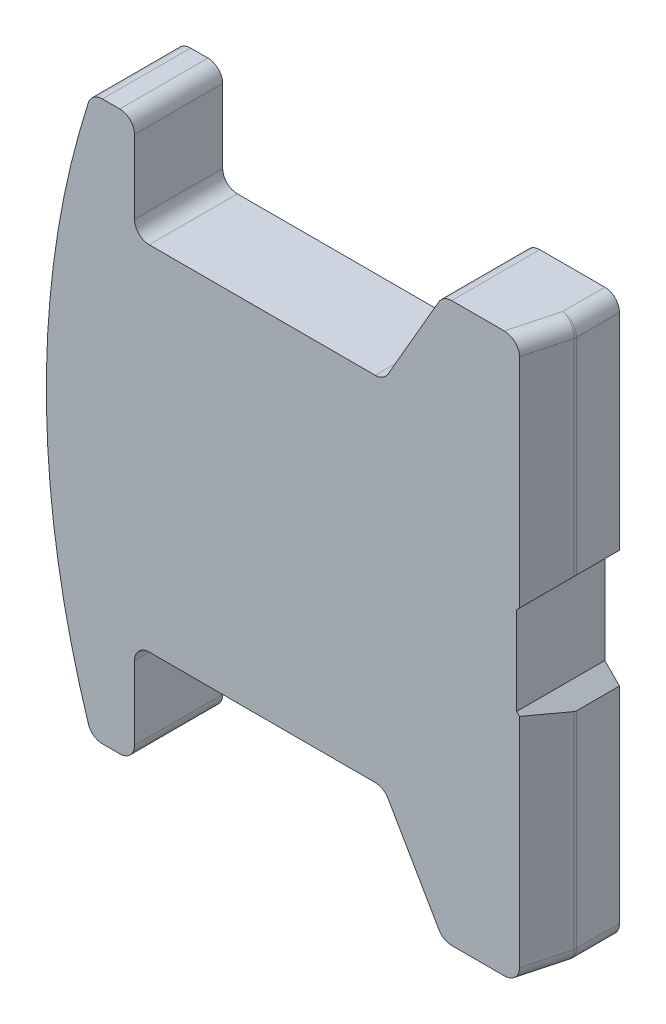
ISO-10303-21;
HEADER;
FILE_DESCRIPTION(('STEP AP214'),'2;1');
FILE_NAME('part.step','',(''),(''),'','','');
FILE_SCHEMA(('AUTOMOTIVE_DESIGN { 1 0 10303 214 1 1 1 1 }'));
ENDSEC;
DATA;
#1=APPLICATION_CONTEXT('core data for automotive mechanical design processes');
#2=APPLICATION_PROTOCOL_DEFINITION('international standard','automotive_design',2000,#1);
#3=PRODUCT_CONTEXT('',#1,'mechanical');
#4=PRODUCT('Part','Part','',(#3));
#5=PRODUCT_RELATED_PRODUCT_CATEGORY('part','',(#4));
#6=PRODUCT_DEFINITION_FORMATION('','',#4);
#7=PRODUCT_DEFINITION_CONTEXT('part definition',#1,'design');
#8=PRODUCT_DEFINITION('design','',#6,#7);
#9=PRODUCT_DEFINITION_SHAPE('','',#8);
#10=(LENGTH_UNIT() NAMED_UNIT(*) SI_UNIT(.MILLI.,.METRE.));
#11=(NAMED_UNIT(*) PLANE_ANGLE_UNIT() SI_UNIT($,.RADIAN.));
#12=(NAMED_UNIT(*) SI_UNIT($,.STERADIAN.) SOLID_ANGLE_UNIT());
#13=UNCERTAINTY_MEASURE_WITH_UNIT(LENGTH_MEASURE(1.E-05),#10,'distance_accuracy_value','');
#14=(GEOMETRIC_REPRESENTATION_CONTEXT(3) GLOBAL_UNCERTAINTY_ASSIGNED_CONTEXT((#13)) GLOBAL_UNIT_ASSIGNED_CONTEXT((#10,
#11,#12)) REPRESENTATION_CONTEXT('',''));
#15=CARTESIAN_POINT('',(0.,0.,0.));
#16=DIRECTION('',(0.,0.,1.));
#17=DIRECTION('',(1.,0.,0.));
#18=AXIS2_PLACEMENT_3D('',#15,#16,#17);
#19=CARTESIAN_POINT('',(-28.,19.,6.));
#20=DIRECTION('',(0.,-1.,0.));
#21=DIRECTION('',(1.,0.,0.));
#22=AXIS2_PLACEMENT_3D('',#19,#20,#21);
#23=PLANE('',#22);
#24=DIRECTION('',(-1.,0.,0.));
#25=VECTOR('',#24,1.);
#26=CARTESIAN_POINT('',(-28.,19.,0.));
#27=LINE('',#26,#25);
#28=CARTESIAN_POINT('',(-28.,19.,0.));
#29=VERTEX_POINT('',#28);
#30=CARTESIAN_POINT('',(-29.1871871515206,19.,0.));
#31=VERTEX_POINT('',#30);
#32=EDGE_CURVE('E437',#29,#31,#27,.T.);
#33=ORIENTED_EDGE('',*,*,#32,.T.);
#34=DIRECTION('',(0.,0.,1.));
#35=VECTOR('',#34,1.);
#36=CARTESIAN_POINT('',(-29.1871871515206,19.,6.));
#37=LINE('',#36,#35);
#38=CARTESIAN_POINT('',(-29.1871871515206,19.,6.));
#39=VERTEX_POINT('',#38);
#40=EDGE_CURVE('E37',#31,#39,#37,.T.);
#41=ORIENTED_EDGE('',*,*,#40,.T.);
#42=DIRECTION('',(1.,0.,0.));
#43=VECTOR('',#42,1.);
#44=CARTESIAN_POINT('',(-28.,19.,6.));
#45=LINE('',#44,#43);
#46=CARTESIAN_POINT('',(-28.,19.,6.));
#47=VERTEX_POINT('',#46);
#48=EDGE_CURVE('E228',#39,#47,#45,.T.);
#49=ORIENTED_EDGE('',*,*,#48,.T.);
#50=DIRECTION('',(0.,0.,-1.));
#51=VECTOR('',#50,1.);
#52=CARTESIAN_POINT('',(-28.,19.,6.));
#53=LINE('',#52,#51);
#54=EDGE_CURVE('E231',#47,#29,#53,.T.);
#55=ORIENTED_EDGE('',*,*,#54,.T.);
#56=EDGE_LOOP('',(#33,#41,#49,#55));
#57=FACE_BOUND('',#56,.T.);
#58=ADVANCED_FACE('F14',(#57),#23,.F.);
#59=CARTESIAN_POINT('',(-28.,-19.,6.));
#60=DIRECTION('',(0.,1.,0.));
#61=DIRECTION('',(-1.,0.,0.));
#62=AXIS2_PLACEMENT_3D('',#59,#60,#61);
#63=PLANE('',#62);
#64=DIRECTION('',(-1.,0.,0.));
#65=VECTOR('',#64,1.);
#66=CARTESIAN_POINT('',(-30.5,-19.,6.));
#67=LINE('',#66,#65);
#68=CARTESIAN_POINT('',(-28.,-19.,6.));
#69=VERTEX_POINT('',#68);
#70=CARTESIAN_POINT('',(-29.1871871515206,-19.,6.));
#71=VERTEX_POINT('',#70);
#72=EDGE_CURVE('E376',#69,#71,#67,.T.);
#73=ORIENTED_EDGE('',*,*,#72,.T.);
#74=DIRECTION('',(0.,0.,1.));
#75=VECTOR('',#74,1.);
#76=CARTESIAN_POINT('',(-29.1871871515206,-19.,0.));
#77=LINE('',#76,#75);
#78=CARTESIAN_POINT('',(-29.1871871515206,-19.,0.));
#79=VERTEX_POINT('',#78);
#80=EDGE_CURVE('E9',#71,#79,#77,.F.);
#81=ORIENTED_EDGE('',*,*,#80,.T.);
#82=DIRECTION('',(1.,0.,0.));
#83=VECTOR('',#82,1.);
#84=CARTESIAN_POINT('',(-28.,-19.,0.));
#85=LINE('',#84,#83);
#86=CARTESIAN_POINT('',(-28.,-19.,0.));
#87=VERTEX_POINT('',#86);
#88=EDGE_CURVE('E438',#79,#87,#85,.T.);
#89=ORIENTED_EDGE('',*,*,#88,.T.);
#90=DIRECTION('',(0.,0.,-1.));
#91=VECTOR('',#90,1.);
#92=CARTESIAN_POINT('',(-28.,-19.,6.));
#93=LINE('',#92,#91);
#94=EDGE_CURVE('E249',#69,#87,#93,.T.);
#95=ORIENTED_EDGE('',*,*,#94,.F.);
#96=EDGE_LOOP('',(#73,#81,#89,#95));
#97=FACE_BOUND('',#96,.T.);
#98=ADVANCED_FACE('F658',(#97),#63,.F.);
#99=CARTESIAN_POINT('',(-26.,-13.,6.));
#100=DIRECTION('',(0.,0.,1.));
#101=DIRECTION('',(0.,1.,0.));
#102=AXIS2_PLACEMENT_3D('',#99,#100,#101);
#103=PLANE('',#102);
#104=ORIENTED_EDGE('',*,*,#48,.F.);
#105=CARTESIAN_POINT('',(-29.1871871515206,18.,6.));
#106=DIRECTION('',(0.,0.,1.));
#107=DIRECTION('',(0.,1.,0.));
#108=AXIS2_PLACEMENT_3D('',#105,#106,#107);
#109=CIRCLE('',#108,1.);
#110=CARTESIAN_POINT('',(-30.1395123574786,18.3050847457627,6.));
#111=VERTEX_POINT('',#110);
#112=EDGE_CURVE('E22',#39,#111,#109,.T.);
#113=ORIENTED_EDGE('',*,*,#112,.T.);
#114=CARTESIAN_POINT('',(27.,0.,6.));
#115=DIRECTION('',(0.,0.,-1.));
#116=DIRECTION('',(0.,-1.,0.));
#117=AXIS2_PLACEMENT_3D('',#114,#115,#116);
#118=CIRCLE('',#117,60.);
#119=CARTESIAN_POINT('',(-30.1395123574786,-18.3050847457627,6.));
#120=VERTEX_POINT('',#119);
#121=EDGE_CURVE('E415',#120,#111,#118,.T.);
#122=ORIENTED_EDGE('',*,*,#121,.F.);
#123=CARTESIAN_POINT('',(-29.1871871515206,-18.,6.));
#124=DIRECTION('',(0.,0.,1.));
#125=DIRECTION('',(0.,1.,0.));
#126=AXIS2_PLACEMENT_3D('',#123,#124,#125);
#127=CIRCLE('',#126,1.);
#128=EDGE_CURVE('E29',#120,#71,#127,.T.);
#129=ORIENTED_EDGE('',*,*,#128,.T.);
#130=ORIENTED_EDGE('',*,*,#72,.F.);
#131=CARTESIAN_POINT('',(-28.,-18.,6.));
#132=DIRECTION('',(0.,0.,1.));
#133=DIRECTION('',(0.,1.,0.));
#134=AXIS2_PLACEMENT_3D('',#131,#132,#133);
#135=CIRCLE('',#134,1.);
#136=CARTESIAN_POINT('',(-27.,-18.,6.));
#137=VERTEX_POINT('',#136);
#138=EDGE_CURVE('E650',#137,#69,#135,.F.);
#139=ORIENTED_EDGE('',*,*,#138,.F.);
#140=DIRECTION('',(0.,-1.,0.));
#141=VECTOR('',#140,1.);
#142=CARTESIAN_POINT('',(-27.,-18.,6.));
#143=LINE('',#142,#141);
#144=CARTESIAN_POINT('',(-27.,-13.,6.));
#145=VERTEX_POINT('',#144);
#146=EDGE_CURVE('E454',#145,#137,#143,.T.);
#147=ORIENTED_EDGE('',*,*,#146,.F.);
#148=CARTESIAN_POINT('',(-26.,-13.,6.));
#149=DIRECTION('',(0.,0.,-1.));
#150=DIRECTION('',(0.,1.,0.));
#151=AXIS2_PLACEMENT_3D('',#148,#149,#150);
#152=CIRCLE('',#151,1.);
#153=CARTESIAN_POINT('',(-26.,-12.,6.));
#154=VERTEX_POINT('',#153);
#155=EDGE_CURVE('E314',#145,#154,#152,.T.);
#156=ORIENTED_EDGE('',*,*,#155,.T.);
#157=DIRECTION('',(1.,0.,0.));
#158=VECTOR('',#157,1.);
#159=CARTESIAN_POINT('',(-10.618802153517,-12.,6.));
#160=LINE('',#159,#158);
#161=CARTESIAN_POINT('',(-10.618802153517,-12.,6.));
#162=VERTEX_POINT('',#161);
#163=EDGE_CURVE('E317',#154,#162,#160,.T.);
#164=ORIENTED_EDGE('',*,*,#163,.T.);
#165=CARTESIAN_POINT('',(-10.618802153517,-13.,6.));
#166=DIRECTION('',(0.,0.,-1.));
#167=DIRECTION('',(0.,1.,0.));
#168=AXIS2_PLACEMENT_3D('',#165,#166,#167);
#169=CIRCLE('',#168,1.);
#170=CARTESIAN_POINT('',(-9.75277674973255,-12.5,6.));
#171=VERTEX_POINT('',#170);
#172=EDGE_CURVE('E578',#162,#171,#169,.T.);
#173=ORIENTED_EDGE('',*,*,#172,.T.);
#174=DIRECTION('',(0.5,-0.866025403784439,0.));
#175=VECTOR('',#174,1.);
#176=CARTESIAN_POINT('',(-6.28867513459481,-18.5,6.));
#177=LINE('',#176,#175);
#178=CARTESIAN_POINT('',(-6.28867513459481,-18.5,6.));
#179=VERTEX_POINT('',#178);
#180=EDGE_CURVE('E580',#171,#179,#177,.T.);
#181=ORIENTED_EDGE('',*,*,#180,.T.);
#182=CARTESIAN_POINT('',(-5.42264973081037,-18.,6.));
#183=DIRECTION('',(0.,0.,1.));
#184=DIRECTION('',(0.,-1.,0.));
#185=AXIS2_PLACEMENT_3D('',#182,#183,#184);
#186=CIRCLE('',#185,1.);
#187=CARTESIAN_POINT('',(-5.42264973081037,-19.,6.));
#188=VERTEX_POINT('',#187);
#189=EDGE_CURVE('E582',#179,#188,#186,.T.);
#190=ORIENTED_EDGE('',*,*,#189,.T.);
#191=DIRECTION('',(1.,0.,0.));
#192=VECTOR('',#191,1.);
#193=CARTESIAN_POINT('',(0.,-19.,6.));
#194=LINE('',#193,#192);
#195=CARTESIAN_POINT('',(-1.83912375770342,-19.,6.));
#196=VERTEX_POINT('',#195);
#197=EDGE_CURVE('E584',#188,#196,#194,.T.);
#198=ORIENTED_EDGE('',*,*,#197,.T.);
#199=CARTESIAN_POINT('',(-1.83912375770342,-18.,6.));
#200=DIRECTION('',(0.,0.,1.));
#201=DIRECTION('',(-1.,0.,0.));
#202=AXIS2_PLACEMENT_3D('',#199,#200,#201);
#203=ELLIPSE('',#202,1.03527618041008,1.);
#204=CARTESIAN_POINT('',(-0.803847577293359,-18.,6.));
#205=VERTEX_POINT('',#204);
#206=EDGE_CURVE('E345',#196,#205,#203,.T.);
#207=ORIENTED_EDGE('',*,*,#206,.T.);
#208=DIRECTION('',(0.,-1.,0.));
#209=VECTOR('',#208,1.);
#210=CARTESIAN_POINT('',(-0.803847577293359,-13.,6.));
#211=LINE('',#210,#209);
#212=CARTESIAN_POINT('',(-0.803847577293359,-3.19615242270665,6.));
#213=VERTEX_POINT('',#212);
#214=EDGE_CURVE('E299',#213,#205,#211,.T.);
#215=ORIENTED_EDGE('',*,*,#214,.F.);
#216=DIRECTION('',(-0.707106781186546,0.707106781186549,0.));
#217=VECTOR('',#216,1.);
#218=CARTESIAN_POINT('',(0.,-4.,6.));
#219=LINE('',#218,#217);
#220=CARTESIAN_POINT('',(-1.,-3.,6.));
#221=VERTEX_POINT('',#220);
#222=EDGE_CURVE('E587',#213,#221,#219,.T.);
#223=ORIENTED_EDGE('',*,*,#222,.T.);
#224=DIRECTION('',(0.,1.,0.));
#225=VECTOR('',#224,1.);
#226=CARTESIAN_POINT('',(-1.,-3.,6.));
#227=LINE('',#226,#225);
#228=CARTESIAN_POINT('',(-1.,3.,6.));
#229=VERTEX_POINT('',#228);
#230=EDGE_CURVE('E589',#221,#229,#227,.T.);
#231=ORIENTED_EDGE('',*,*,#230,.T.);
#232=DIRECTION('',(0.707106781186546,0.70710678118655,0.));
#233=VECTOR('',#232,1.);
#234=CARTESIAN_POINT('',(0.,4.,6.));
#235=LINE('',#234,#233);
#236=CARTESIAN_POINT('',(-0.80384757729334,3.19615242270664,6.));
#237=VERTEX_POINT('',#236);
#238=EDGE_CURVE('E591',#229,#237,#235,.T.);
#239=ORIENTED_EDGE('',*,*,#238,.T.);
#240=CARTESIAN_POINT('',(-0.803847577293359,18.,6.));
#241=VERTEX_POINT('',#240);
#242=EDGE_CURVE('E323',#241,#237,#211,.T.);
#243=ORIENTED_EDGE('',*,*,#242,.F.);
#244=CARTESIAN_POINT('',(-1.83912375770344,18.,6.));
#245=DIRECTION('',(0.,0.,1.));
#246=DIRECTION('',(1.,0.,0.));
#247=AXIS2_PLACEMENT_3D('',#244,#245,#246);
#248=ELLIPSE('',#247,1.03527618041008,1.);
#249=CARTESIAN_POINT('',(-1.83912375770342,19.,6.));
#250=VERTEX_POINT('',#249);
#251=EDGE_CURVE('E343',#241,#250,#248,.T.);
#252=ORIENTED_EDGE('',*,*,#251,.T.);
#253=DIRECTION('',(-1.,0.,0.));
#254=VECTOR('',#253,1.);
#255=CARTESIAN_POINT('',(-5.42264973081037,19.,6.));
#256=LINE('',#255,#254);
#257=CARTESIAN_POINT('',(-5.42264973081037,19.,6.));
#258=VERTEX_POINT('',#257);
#259=EDGE_CURVE('E545',#250,#258,#256,.T.);
#260=ORIENTED_EDGE('',*,*,#259,.T.);
#261=CARTESIAN_POINT('',(-5.42264973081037,18.,6.));
#262=DIRECTION('',(0.,0.,1.));
#263=DIRECTION('',(0.,1.,0.));
#264=AXIS2_PLACEMENT_3D('',#261,#262,#263);
#265=CIRCLE('',#264,1.);
#266=CARTESIAN_POINT('',(-6.28867513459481,18.5,6.));
#267=VERTEX_POINT('',#266);
#268=EDGE_CURVE('E540',#258,#267,#265,.T.);
#269=ORIENTED_EDGE('',*,*,#268,.T.);
#270=DIRECTION('',(-0.5,-0.86602540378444,0.));
#271=VECTOR('',#270,1.);
#272=CARTESIAN_POINT('',(-9.75277674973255,12.5,6.));
#273=LINE('',#272,#271);
#274=CARTESIAN_POINT('',(-9.75277674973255,12.5,6.));
#275=VERTEX_POINT('',#274);
#276=EDGE_CURVE('E536',#267,#275,#273,.T.);
#277=ORIENTED_EDGE('',*,*,#276,.T.);
#278=CARTESIAN_POINT('',(-10.618802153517,13.,6.));
#279=DIRECTION('',(0.,0.,-1.));
#280=DIRECTION('',(0.,-1.,0.));
#281=AXIS2_PLACEMENT_3D('',#278,#279,#280);
#282=CIRCLE('',#281,1.);
#283=CARTESIAN_POINT('',(-10.618802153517,12.,6.));
#284=VERTEX_POINT('',#283);
#285=EDGE_CURVE('E527',#275,#284,#282,.T.);
#286=ORIENTED_EDGE('',*,*,#285,.T.);
#287=DIRECTION('',(-1.,0.,0.));
#288=VECTOR('',#287,1.);
#289=CARTESIAN_POINT('',(-26.,12.,6.));
#290=LINE('',#289,#288);
#291=CARTESIAN_POINT('',(-26.,12.,6.));
#292=VERTEX_POINT('',#291);
#293=EDGE_CURVE('E303',#284,#292,#290,.T.);
#294=ORIENTED_EDGE('',*,*,#293,.T.);
#295=CARTESIAN_POINT('',(-26.,13.,6.));
#296=DIRECTION('',(0.,0.,-1.));
#297=DIRECTION('',(0.,-1.,0.));
#298=AXIS2_PLACEMENT_3D('',#295,#296,#297);
#299=CIRCLE('',#298,1.);
#300=CARTESIAN_POINT('',(-27.,13.,6.));
#301=VERTEX_POINT('',#300);
#302=EDGE_CURVE('E300',#292,#301,#299,.T.);
#303=ORIENTED_EDGE('',*,*,#302,.T.);
#304=CARTESIAN_POINT('',(-27.,18.,6.));
#305=VERTEX_POINT('',#304);
#306=EDGE_CURVE('E240',#305,#301,#143,.T.);
#307=ORIENTED_EDGE('',*,*,#306,.F.);
#308=CARTESIAN_POINT('',(-28.,18.,6.));
#309=DIRECTION('',(0.,0.,1.));
#310=DIRECTION('',(0.,1.,0.));
#311=AXIS2_PLACEMENT_3D('',#308,#309,#310);
#312=CIRCLE('',#311,1.);
#313=EDGE_CURVE('E235',#47,#305,#312,.F.);
#314=ORIENTED_EDGE('',*,*,#313,.F.);
#315=EDGE_LOOP('',(#104,#113,#122,#129,#130,#139,#147,#156,#164,#173,#181,#190,#198,#207,#215,
#223,#231,#239,#243,#252,#260,#269,#277,#286,#294,#303,#307,#314));
#316=FACE_BOUND('',#315,.T.);
#317=ADVANCED_FACE('F238',(#316),#103,.T.);
#318=CARTESIAN_POINT('',(-26.,-13.,0.));
#319=DIRECTION('',(0.,0.,1.));
#320=DIRECTION('',(0.,1.,0.));
#321=AXIS2_PLACEMENT_3D('',#318,#319,#320);
#322=PLANE('',#321);
#323=CARTESIAN_POINT('',(27.,0.,0.));
#324=DIRECTION('',(0.,0.,-1.));
#325=DIRECTION('',(0.,-1.,0.));
#326=AXIS2_PLACEMENT_3D('',#323,#324,#325);
#327=CIRCLE('',#326,60.);
#328=CARTESIAN_POINT('',(-30.1395123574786,-18.3050847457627,0.));
#329=VERTEX_POINT('',#328);
#330=CARTESIAN_POINT('',(-30.1395123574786,18.3050847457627,0.));
#331=VERTEX_POINT('',#330);
#332=EDGE_CURVE('E418',#329,#331,#327,.T.);
#333=ORIENTED_EDGE('',*,*,#332,.T.);
#334=CARTESIAN_POINT('',(-29.1871871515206,18.,0.));
#335=DIRECTION('',(0.,0.,1.));
#336=DIRECTION('',(0.,1.,0.));
#337=AXIS2_PLACEMENT_3D('',#334,#335,#336);
#338=CIRCLE('',#337,1.);
#339=EDGE_CURVE('E425',#331,#31,#338,.F.);
#340=ORIENTED_EDGE('',*,*,#339,.T.);
#341=ORIENTED_EDGE('',*,*,#32,.F.);
#342=CARTESIAN_POINT('',(-28.,18.,0.));
#343=DIRECTION('',(0.,0.,1.));
#344=DIRECTION('',(0.,1.,0.));
#345=AXIS2_PLACEMENT_3D('',#342,#343,#344);
#346=CIRCLE('',#345,1.);
#347=CARTESIAN_POINT('',(-27.,18.,0.));
#348=VERTEX_POINT('',#347);
#349=EDGE_CURVE('E246',#348,#29,#346,.T.);
#350=ORIENTED_EDGE('',*,*,#349,.F.);
#351=DIRECTION('',(0.,1.,0.));
#352=VECTOR('',#351,1.);
#353=CARTESIAN_POINT('',(-27.,18.,0.));
#354=LINE('',#353,#352);
#355=CARTESIAN_POINT('',(-27.,13.,0.));
#356=VERTEX_POINT('',#355);
#357=EDGE_CURVE('E442',#356,#348,#354,.T.);
#358=ORIENTED_EDGE('',*,*,#357,.F.);
#359=CARTESIAN_POINT('',(-26.,13.,0.));
#360=DIRECTION('',(0.,0.,-1.));
#361=DIRECTION('',(0.,-1.,0.));
#362=AXIS2_PLACEMENT_3D('',#359,#360,#361);
#363=CIRCLE('',#362,1.);
#364=CARTESIAN_POINT('',(-26.,12.,0.));
#365=VERTEX_POINT('',#364);
#366=EDGE_CURVE('E507',#365,#356,#363,.T.);
#367=ORIENTED_EDGE('',*,*,#366,.F.);
#368=DIRECTION('',(-1.,0.,0.));
#369=VECTOR('',#368,1.);
#370=CARTESIAN_POINT('',(-26.,12.,0.));
#371=LINE('',#370,#369);
#372=CARTESIAN_POINT('',(-10.618802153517,12.,0.));
#373=VERTEX_POINT('',#372);
#374=EDGE_CURVE('E505',#373,#365,#371,.T.);
#375=ORIENTED_EDGE('',*,*,#374,.F.);
#376=CARTESIAN_POINT('',(-10.618802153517,13.,0.));
#377=DIRECTION('',(0.,0.,-1.));
#378=DIRECTION('',(0.,-1.,0.));
#379=AXIS2_PLACEMENT_3D('',#376,#377,#378);
#380=CIRCLE('',#379,1.);
#381=CARTESIAN_POINT('',(-9.75277674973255,12.5,0.));
#382=VERTEX_POINT('',#381);
#383=EDGE_CURVE('E503',#382,#373,#380,.T.);
#384=ORIENTED_EDGE('',*,*,#383,.F.);
#385=DIRECTION('',(-0.5,-0.86602540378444,0.));
#386=VECTOR('',#385,1.);
#387=CARTESIAN_POINT('',(-9.75277674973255,12.5,0.));
#388=LINE('',#387,#386);
#389=CARTESIAN_POINT('',(-6.28867513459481,18.5,0.));
#390=VERTEX_POINT('',#389);
#391=EDGE_CURVE('E501',#390,#382,#388,.T.);
#392=ORIENTED_EDGE('',*,*,#391,.F.);
#393=CARTESIAN_POINT('',(-5.42264973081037,18.,0.));
#394=DIRECTION('',(0.,0.,1.));
#395=DIRECTION('',(0.,1.,0.));
#396=AXIS2_PLACEMENT_3D('',#393,#394,#395);
#397=CIRCLE('',#396,1.);
#398=CARTESIAN_POINT('',(-5.42264973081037,19.,0.));
#399=VERTEX_POINT('',#398);
#400=EDGE_CURVE('E499',#399,#390,#397,.T.);
#401=ORIENTED_EDGE('',*,*,#400,.F.);
#402=DIRECTION('',(-1.,0.,0.));
#403=VECTOR('',#402,1.);
#404=CARTESIAN_POINT('',(-5.42264973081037,19.,0.));
#405=LINE('',#404,#403);
#406=CARTESIAN_POINT('',(-1.,19.,0.));
#407=VERTEX_POINT('',#406);
#408=EDGE_CURVE('E497',#407,#399,#405,.T.);
#409=ORIENTED_EDGE('',*,*,#408,.F.);
#410=CARTESIAN_POINT('',(-1.,18.,0.));
#411=DIRECTION('',(0.,0.,1.));
#412=DIRECTION('',(0.,1.,0.));
#413=AXIS2_PLACEMENT_3D('',#410,#411,#412);
#414=CIRCLE('',#413,1.);
#415=CARTESIAN_POINT('',(0.,18.,0.));
#416=VERTEX_POINT('',#415);
#417=EDGE_CURVE('E362',#407,#416,#414,.F.);
#418=ORIENTED_EDGE('',*,*,#417,.T.);
#419=DIRECTION('',(0.,1.,0.));
#420=VECTOR('',#419,1.);
#421=CARTESIAN_POINT('',(0.,19.,0.));
#422=LINE('',#421,#420);
#423=CARTESIAN_POINT('',(0.,4.,0.));
#424=VERTEX_POINT('',#423);
#425=EDGE_CURVE('E494',#424,#416,#422,.T.);
#426=ORIENTED_EDGE('',*,*,#425,.F.);
#427=DIRECTION('',(0.707106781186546,0.70710678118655,0.));
#428=VECTOR('',#427,1.);
#429=CARTESIAN_POINT('',(0.,4.,0.));
#430=LINE('',#429,#428);
#431=CARTESIAN_POINT('',(-1.,3.,0.));
#432=VERTEX_POINT('',#431);
#433=EDGE_CURVE('E491',#432,#424,#430,.T.);
#434=ORIENTED_EDGE('',*,*,#433,.F.);
#435=DIRECTION('',(0.,1.,0.));
#436=VECTOR('',#435,1.);
#437=CARTESIAN_POINT('',(-1.,-3.,0.));
#438=LINE('',#437,#436);
#439=CARTESIAN_POINT('',(-1.,-3.,0.));
#440=VERTEX_POINT('',#439);
#441=EDGE_CURVE('E489',#440,#432,#438,.T.);
#442=ORIENTED_EDGE('',*,*,#441,.F.);
#443=DIRECTION('',(-0.707106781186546,0.707106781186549,0.));
#444=VECTOR('',#443,1.);
#445=CARTESIAN_POINT('',(0.,-4.,0.));
#446=LINE('',#445,#444);
#447=CARTESIAN_POINT('',(0.,-4.,0.));
#448=VERTEX_POINT('',#447);
#449=EDGE_CURVE('E487',#448,#440,#446,.T.);
#450=ORIENTED_EDGE('',*,*,#449,.F.);
#451=DIRECTION('',(0.,1.,0.));
#452=VECTOR('',#451,1.);
#453=CARTESIAN_POINT('',(0.,-4.,0.));
#454=LINE('',#453,#452);
#455=CARTESIAN_POINT('',(0.,-18.,0.));
#456=VERTEX_POINT('',#455);
#457=EDGE_CURVE('E485',#456,#448,#454,.T.);
#458=ORIENTED_EDGE('',*,*,#457,.F.);
#459=CARTESIAN_POINT('',(-1.,-18.,0.));
#460=DIRECTION('',(0.,0.,1.));
#461=DIRECTION('',(0.,1.,0.));
#462=AXIS2_PLACEMENT_3D('',#459,#460,#461);
#463=CIRCLE('',#462,1.);
#464=CARTESIAN_POINT('',(-1.,-19.,0.));
#465=VERTEX_POINT('',#464);
#466=EDGE_CURVE('E364',#456,#465,#463,.F.);
#467=ORIENTED_EDGE('',*,*,#466,.T.);
#468=DIRECTION('',(1.,0.,0.));
#469=VECTOR('',#468,1.);
#470=CARTESIAN_POINT('',(0.,-19.,0.));
#471=LINE('',#470,#469);
#472=CARTESIAN_POINT('',(-5.42264973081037,-19.,0.));
#473=VERTEX_POINT('',#472);
#474=EDGE_CURVE('E482',#473,#465,#471,.T.);
#475=ORIENTED_EDGE('',*,*,#474,.F.);
#476=CARTESIAN_POINT('',(-5.42264973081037,-18.,0.));
#477=DIRECTION('',(0.,0.,1.));
#478=DIRECTION('',(0.,-1.,0.));
#479=AXIS2_PLACEMENT_3D('',#476,#477,#478);
#480=CIRCLE('',#479,1.);
#481=CARTESIAN_POINT('',(-6.28867513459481,-18.5,0.));
#482=VERTEX_POINT('',#481);
#483=EDGE_CURVE('E480',#482,#473,#480,.T.);
#484=ORIENTED_EDGE('',*,*,#483,.F.);
#485=DIRECTION('',(0.5,-0.866025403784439,0.));
#486=VECTOR('',#485,1.);
#487=CARTESIAN_POINT('',(-6.28867513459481,-18.5,0.));
#488=LINE('',#487,#486);
#489=CARTESIAN_POINT('',(-9.75277674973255,-12.5,0.));
#490=VERTEX_POINT('',#489);
#491=EDGE_CURVE('E478',#490,#482,#488,.T.);
#492=ORIENTED_EDGE('',*,*,#491,.F.);
#493=CARTESIAN_POINT('',(-10.618802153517,-13.,0.));
#494=DIRECTION('',(0.,0.,-1.));
#495=DIRECTION('',(0.,1.,0.));
#496=AXIS2_PLACEMENT_3D('',#493,#494,#495);
#497=CIRCLE('',#496,1.);
#498=CARTESIAN_POINT('',(-10.618802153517,-12.,0.));
#499=VERTEX_POINT('',#498);
#500=EDGE_CURVE('E470',#499,#490,#497,.T.);
#501=ORIENTED_EDGE('',*,*,#500,.F.);
#502=DIRECTION('',(1.,0.,0.));
#503=VECTOR('',#502,1.);
#504=CARTESIAN_POINT('',(-10.618802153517,-12.,0.));
#505=LINE('',#504,#503);
#506=CARTESIAN_POINT('',(-26.,-12.,0.));
#507=VERTEX_POINT('',#506);
#508=EDGE_CURVE('E465',#507,#499,#505,.T.);
#509=ORIENTED_EDGE('',*,*,#508,.F.);
#510=CARTESIAN_POINT('',(-26.,-13.,0.));
#511=DIRECTION('',(0.,0.,-1.));
#512=DIRECTION('',(0.,1.,0.));
#513=AXIS2_PLACEMENT_3D('',#510,#511,#512);
#514=CIRCLE('',#513,1.);
#515=CARTESIAN_POINT('',(-27.,-13.,0.));
#516=VERTEX_POINT('',#515);
#517=EDGE_CURVE('E463',#516,#507,#514,.T.);
#518=ORIENTED_EDGE('',*,*,#517,.F.);
#519=DIRECTION('',(0.,1.,0.));
#520=VECTOR('',#519,1.);
#521=CARTESIAN_POINT('',(-27.,-18.,0.));
#522=LINE('',#521,#520);
#523=CARTESIAN_POINT('',(-27.,-18.,0.));
#524=VERTEX_POINT('',#523);
#525=EDGE_CURVE('E318',#524,#516,#522,.T.);
#526=ORIENTED_EDGE('',*,*,#525,.F.);
#527=CARTESIAN_POINT('',(-28.,-18.,0.));
#528=DIRECTION('',(0.,0.,1.));
#529=DIRECTION('',(0.,1.,0.));
#530=AXIS2_PLACEMENT_3D('',#527,#528,#529);
#531=CIRCLE('',#530,1.);
#532=EDGE_CURVE('E440',#87,#524,#531,.T.);
#533=ORIENTED_EDGE('',*,*,#532,.F.);
#534=ORIENTED_EDGE('',*,*,#88,.F.);
#535=CARTESIAN_POINT('',(-29.1871871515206,-18.,0.));
#536=DIRECTION('',(0.,0.,1.));
#537=DIRECTION('',(0.,1.,0.));
#538=AXIS2_PLACEMENT_3D('',#535,#536,#537);
#539=CIRCLE('',#538,1.);
#540=EDGE_CURVE('E423',#79,#329,#539,.F.);
#541=ORIENTED_EDGE('',*,*,#540,.T.);
#542=EDGE_LOOP('',(#333,#340,#341,#350,#358,#367,#375,#384,#392,#401,#409,#418,#426,#434,#442,
#450,#458,#467,#475,#484,#492,#501,#509,#518,#526,#533,#534,#541));
#543=FACE_BOUND('',#542,.T.);
#544=ADVANCED_FACE('F436',(#543),#322,.F.);
#545=CARTESIAN_POINT('',(-28.,18.,6.));
#546=DIRECTION('',(0.,0.,-1.));
#547=DIRECTION('',(0.,-1.,0.));
#548=AXIS2_PLACEMENT_3D('',#545,#546,#547);
#549=CYLINDRICAL_SURFACE('',#548,1.);
#550=ORIENTED_EDGE('',*,*,#313,.T.);
#551=DIRECTION('',(0.,0.,-1.));
#552=VECTOR('',#551,1.);
#553=CARTESIAN_POINT('',(-27.,18.,6.));
#554=LINE('',#553,#552);
#555=EDGE_CURVE('E248',#305,#348,#554,.T.);
#556=ORIENTED_EDGE('',*,*,#555,.T.);
#557=ORIENTED_EDGE('',*,*,#349,.T.);
#558=ORIENTED_EDGE('',*,*,#54,.F.);
#559=EDGE_LOOP('',(#550,#556,#557,#558));
#560=FACE_BOUND('',#559,.T.);
#561=ADVANCED_FACE('F244',(#560),#549,.T.);
#562=CARTESIAN_POINT('',(-28.,-18.,6.));
#563=DIRECTION('',(0.,0.,-1.));
#564=DIRECTION('',(0.,-1.,0.));
#565=AXIS2_PLACEMENT_3D('',#562,#563,#564);
#566=CYLINDRICAL_SURFACE('',#565,1.);
#567=ORIENTED_EDGE('',*,*,#138,.T.);
#568=ORIENTED_EDGE('',*,*,#94,.T.);
#569=ORIENTED_EDGE('',*,*,#532,.T.);
#570=DIRECTION('',(0.,0.,-1.));
#571=VECTOR('',#570,1.);
#572=CARTESIAN_POINT('',(-27.,-18.,6.));
#573=LINE('',#572,#571);
#574=EDGE_CURVE('E254',#137,#524,#573,.T.);
#575=ORIENTED_EDGE('',*,*,#574,.F.);
#576=EDGE_LOOP('',(#567,#568,#569,#575));
#577=FACE_BOUND('',#576,.T.);
#578=ADVANCED_FACE('F458',(#577),#566,.T.);
#579=CARTESIAN_POINT('',(-27.,-18.,6.));
#580=DIRECTION('',(-1.,0.,0.));
#581=DIRECTION('',(0.,-1.,0.));
#582=AXIS2_PLACEMENT_3D('',#579,#580,#581);
#583=PLANE('',#582);
#584=ORIENTED_EDGE('',*,*,#146,.T.);
#585=ORIENTED_EDGE('',*,*,#574,.T.);
#586=ORIENTED_EDGE('',*,*,#525,.T.);
#587=DIRECTION('',(0.,0.,-1.));
#588=VECTOR('',#587,1.);
#589=CARTESIAN_POINT('',(-27.,-13.,6.));
#590=LINE('',#589,#588);
#591=EDGE_CURVE('E302',#145,#516,#590,.T.);
#592=ORIENTED_EDGE('',*,*,#591,.F.);
#593=EDGE_LOOP('',(#584,#585,#586,#592));
#594=FACE_BOUND('',#593,.T.);
#595=ADVANCED_FACE('F451',(#594),#583,.F.);
#596=ORIENTED_EDGE('',*,*,#306,.T.);
#597=DIRECTION('',(0.,0.,-1.));
#598=VECTOR('',#597,1.);
#599=CARTESIAN_POINT('',(-27.,13.,6.));
#600=LINE('',#599,#598);
#601=EDGE_CURVE('E251',#301,#356,#600,.T.);
#602=ORIENTED_EDGE('',*,*,#601,.T.);
#603=ORIENTED_EDGE('',*,*,#357,.T.);
#604=ORIENTED_EDGE('',*,*,#555,.F.);
#605=EDGE_LOOP('',(#596,#602,#603,#604));
#606=FACE_BOUND('',#605,.T.);
#607=ADVANCED_FACE('F511',(#606),#583,.F.);
#608=CARTESIAN_POINT('',(-26.,-13.,6.));
#609=DIRECTION('',(0.,0.,-1.));
#610=DIRECTION('',(0.,-1.,0.));
#611=AXIS2_PLACEMENT_3D('',#608,#609,#610);
#612=CYLINDRICAL_SURFACE('',#611,1.);
#613=ORIENTED_EDGE('',*,*,#517,.T.);
#614=DIRECTION('',(0.,0.,-1.));
#615=VECTOR('',#614,1.);
#616=CARTESIAN_POINT('',(-26.,-12.,6.));
#617=LINE('',#616,#615);
#618=EDGE_CURVE('E296',#154,#507,#617,.T.);
#619=ORIENTED_EDGE('',*,*,#618,.F.);
#620=ORIENTED_EDGE('',*,*,#155,.F.);
#621=ORIENTED_EDGE('',*,*,#591,.T.);
#622=EDGE_LOOP('',(#613,#619,#620,#621));
#623=FACE_BOUND('',#622,.T.);
#624=ADVANCED_FACE('F649',(#623),#612,.F.);
#625=CARTESIAN_POINT('',(-10.618802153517,-12.,6.));
#626=DIRECTION('',(0.,1.,0.));
#627=DIRECTION('',(-1.,0.,0.));
#628=AXIS2_PLACEMENT_3D('',#625,#626,#627);
#629=PLANE('',#628);
#630=ORIENTED_EDGE('',*,*,#508,.T.);
#631=DIRECTION('',(0.,0.,-1.));
#632=VECTOR('',#631,1.);
#633=CARTESIAN_POINT('',(-10.618802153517,-12.,6.));
#634=LINE('',#633,#632);
#635=EDGE_CURVE('E293',#162,#499,#634,.T.);
#636=ORIENTED_EDGE('',*,*,#635,.F.);
#637=ORIENTED_EDGE('',*,*,#163,.F.);
#638=ORIENTED_EDGE('',*,*,#618,.T.);
#639=EDGE_LOOP('',(#630,#636,#637,#638));
#640=FACE_BOUND('',#639,.T.);
#641=ADVANCED_FACE('F647',(#640),#629,.F.);
#642=CARTESIAN_POINT('',(-10.618802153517,-13.,6.));
#643=DIRECTION('',(0.,0.,-1.));
#644=DIRECTION('',(0.,-1.,0.));
#645=AXIS2_PLACEMENT_3D('',#642,#643,#644);
#646=CYLINDRICAL_SURFACE('',#645,1.);
#647=ORIENTED_EDGE('',*,*,#500,.T.);
#648=DIRECTION('',(0.,0.,-1.));
#649=VECTOR('',#648,1.);
#650=CARTESIAN_POINT('',(-9.75277674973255,-12.5,6.));
#651=LINE('',#650,#649);
#652=EDGE_CURVE('E290',#171,#490,#651,.T.);
#653=ORIENTED_EDGE('',*,*,#652,.F.);
#654=ORIENTED_EDGE('',*,*,#172,.F.);
#655=ORIENTED_EDGE('',*,*,#635,.T.);
#656=EDGE_LOOP('',(#647,#653,#654,#655));
#657=FACE_BOUND('',#656,.T.);
#658=ADVANCED_FACE('F644',(#657),#646,.F.);
#659=CARTESIAN_POINT('',(-6.28867513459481,-18.5,6.));
#660=DIRECTION('',(0.866025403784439,0.5,0.));
#661=DIRECTION('',(-0.5,0.866025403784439,0.));
#662=AXIS2_PLACEMENT_3D('',#659,#660,#661);
#663=PLANE('',#662);
#664=ORIENTED_EDGE('',*,*,#491,.T.);
#665=DIRECTION('',(0.,0.,-1.));
#666=VECTOR('',#665,1.);
#667=CARTESIAN_POINT('',(-6.28867513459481,-18.5,6.));
#668=LINE('',#667,#666);
#669=EDGE_CURVE('E287',#179,#482,#668,.T.);
#670=ORIENTED_EDGE('',*,*,#669,.F.);
#671=ORIENTED_EDGE('',*,*,#180,.F.);
#672=ORIENTED_EDGE('',*,*,#652,.T.);
#673=EDGE_LOOP('',(#664,#670,#671,#672));
#674=FACE_BOUND('',#673,.T.);
#675=ADVANCED_FACE('F640',(#674),#663,.F.);
#676=CARTESIAN_POINT('',(-5.42264973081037,-18.,6.));
#677=DIRECTION('',(0.,0.,-1.));
#678=DIRECTION('',(0.,-1.,0.));
#679=AXIS2_PLACEMENT_3D('',#676,#677,#678);
#680=CYLINDRICAL_SURFACE('',#679,1.);
#681=ORIENTED_EDGE('',*,*,#483,.T.);
#682=DIRECTION('',(0.,0.,-1.));
#683=VECTOR('',#682,1.);
#684=CARTESIAN_POINT('',(-5.42264973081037,-19.,6.));
#685=LINE('',#684,#683);
#686=EDGE_CURVE('E284',#188,#473,#685,.T.);
#687=ORIENTED_EDGE('',*,*,#686,.F.);
#688=ORIENTED_EDGE('',*,*,#189,.F.);
#689=ORIENTED_EDGE('',*,*,#669,.T.);
#690=EDGE_LOOP('',(#681,#687,#688,#689));
#691=FACE_BOUND('',#690,.T.);
#692=ADVANCED_FACE('F634',(#691),#680,.T.);
#693=CARTESIAN_POINT('',(0.,-19.,6.));
#694=DIRECTION('',(0.,1.,0.));
#695=DIRECTION('',(-1.,0.,0.));
#696=AXIS2_PLACEMENT_3D('',#693,#694,#695);
#697=PLANE('',#696);
#698=DIRECTION('',(0.,0.,-1.));
#699=VECTOR('',#698,1.);
#700=CARTESIAN_POINT('',(-1.,-19.,6.));
#701=LINE('',#700,#699);
#702=CARTESIAN_POINT('',(-1.,-19.,2.8683475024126));
#703=VERTEX_POINT('',#702);
#704=EDGE_CURVE('E338',#465,#703,#701,.F.);
#705=ORIENTED_EDGE('',*,*,#704,.T.);
#706=DIRECTION('',(-0.258819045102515,0.,0.96592582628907));
#707=VECTOR('',#706,1.);
#708=CARTESIAN_POINT('',(-1.71592582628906,-19.,5.54021906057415));
#709=LINE('',#708,#707);
#710=EDGE_CURVE('E340',#703,#196,#709,.T.);
#711=ORIENTED_EDGE('',*,*,#710,.T.);
#712=ORIENTED_EDGE('',*,*,#197,.F.);
#713=ORIENTED_EDGE('',*,*,#686,.T.);
#714=ORIENTED_EDGE('',*,*,#474,.T.);
#715=EDGE_LOOP('',(#705,#711,#712,#713,#714));
#716=FACE_BOUND('',#715,.T.);
#717=ADVANCED_FACE('F626',(#716),#697,.F.);
#718=CARTESIAN_POINT('',(0.,-4.,6.));
#719=DIRECTION('',(-1.,0.,0.));
#720=DIRECTION('',(0.,-1.,0.));
#721=AXIS2_PLACEMENT_3D('',#718,#719,#720);
#722=PLANE('',#721);
#723=DIRECTION('',(0.,1.,0.));
#724=VECTOR('',#723,1.);
#725=CARTESIAN_POINT('',(0.,-4.,2.93417375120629));
#726=LINE('',#725,#724);
#727=CARTESIAN_POINT('',(0.,-4.,2.93417375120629));
#728=VERTEX_POINT('',#727);
#729=CARTESIAN_POINT('',(0.,-18.,2.93417375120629));
#730=VERTEX_POINT('',#729);
#731=EDGE_CURVE('E328',#728,#730,#726,.F.);
#732=ORIENTED_EDGE('',*,*,#731,.T.);
#733=DIRECTION('',(0.,0.,-1.));
#734=VECTOR('',#733,1.);
#735=CARTESIAN_POINT('',(0.,-18.,6.));
#736=LINE('',#735,#734);
#737=EDGE_CURVE('E360',#730,#456,#736,.T.);
#738=ORIENTED_EDGE('',*,*,#737,.T.);
#739=ORIENTED_EDGE('',*,*,#457,.T.);
#740=DIRECTION('',(0.,0.,-1.));
#741=VECTOR('',#740,1.);
#742=CARTESIAN_POINT('',(0.,-4.,6.));
#743=LINE('',#742,#741);
#744=EDGE_CURVE('E281',#728,#448,#743,.T.);
#745=ORIENTED_EDGE('',*,*,#744,.F.);
#746=EDGE_LOOP('',(#732,#738,#739,#745));
#747=FACE_BOUND('',#746,.T.);
#748=ADVANCED_FACE('F613',(#747),#722,.F.);
#749=CARTESIAN_POINT('',(0.,-4.,6.));
#750=DIRECTION('',(-0.707106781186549,-0.707106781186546,0.));
#751=DIRECTION('',(0.707106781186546,-0.707106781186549,0.));
#752=AXIS2_PLACEMENT_3D('',#749,#750,#751);
#753=PLANE('',#752);
#754=DIRECTION('',(0.250562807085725,-0.250562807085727,-0.935113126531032));
#755=VECTOR('',#754,1.);
#756=CARTESIAN_POINT('',(-0.70291370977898,-3.29708629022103,5.62330967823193));
#757=LINE('',#756,#755);
#758=CARTESIAN_POINT('',(-0.0170370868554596,-3.98296291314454,3.06358327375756));
#759=VERTEX_POINT('',#758);
#760=EDGE_CURVE('E468',#213,#759,#757,.T.);
#761=ORIENTED_EDGE('',*,*,#760,.T.);
#762=CARTESIAN_POINT('',(-0.5,-3.5,2.93417375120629));
#763=DIRECTION('',(-0.707106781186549,-0.707106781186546,0.));
#764=DIRECTION('',(-0.707106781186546,0.707106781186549,0.));
#765=AXIS2_PLACEMENT_3D('',#762,#763,#764);
#766=ELLIPSE('',#765,0.707106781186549,0.5);
#767=EDGE_CURVE('E326',#759,#728,#766,.F.);
#768=ORIENTED_EDGE('',*,*,#767,.T.);
#769=ORIENTED_EDGE('',*,*,#744,.T.);
#770=ORIENTED_EDGE('',*,*,#449,.T.);
#771=DIRECTION('',(0.,0.,-1.));
#772=VECTOR('',#771,1.);
#773=CARTESIAN_POINT('',(-1.,-3.,6.));
#774=LINE('',#773,#772);
#775=EDGE_CURVE('E278',#221,#440,#774,.T.);
#776=ORIENTED_EDGE('',*,*,#775,.F.);
#777=ORIENTED_EDGE('',*,*,#222,.F.);
#778=EDGE_LOOP('',(#761,#768,#769,#770,#776,#777));
#779=FACE_BOUND('',#778,.T.);
#780=ADVANCED_FACE('F608',(#779),#753,.F.);
#781=CARTESIAN_POINT('',(-1.,-3.,6.));
#782=DIRECTION('',(-1.,0.,0.));
#783=DIRECTION('',(0.,-1.,0.));
#784=AXIS2_PLACEMENT_3D('',#781,#782,#783);
#785=PLANE('',#784);
#786=ORIENTED_EDGE('',*,*,#441,.T.);
#787=DIRECTION('',(0.,0.,-1.));
#788=VECTOR('',#787,1.);
#789=CARTESIAN_POINT('',(-1.,3.,6.));
#790=LINE('',#789,#788);
#791=EDGE_CURVE('E275',#229,#432,#790,.T.);
#792=ORIENTED_EDGE('',*,*,#791,.F.);
#793=ORIENTED_EDGE('',*,*,#230,.F.);
#794=ORIENTED_EDGE('',*,*,#775,.T.);
#795=EDGE_LOOP('',(#786,#792,#793,#794));
#796=FACE_BOUND('',#795,.T.);
#797=ADVANCED_FACE('F604',(#796),#785,.F.);
#798=CARTESIAN_POINT('',(0.,4.,6.));
#799=DIRECTION('',(-0.70710678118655,0.707106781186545,0.));
#800=DIRECTION('',(-0.707106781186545,-0.70710678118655,0.));
#801=AXIS2_PLACEMENT_3D('',#798,#799,#800);
#802=PLANE('',#801);
#803=DIRECTION('',(0.,0.,-1.));
#804=VECTOR('',#803,1.);
#805=CARTESIAN_POINT('',(0.,4.,6.));
#806=LINE('',#805,#804);
#807=CARTESIAN_POINT('',(0.,4.,2.93417375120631));
#808=VERTEX_POINT('',#807);
#809=EDGE_CURVE('E273',#808,#424,#806,.T.);
#810=ORIENTED_EDGE('',*,*,#809,.F.);
#811=CARTESIAN_POINT('',(-0.5,3.5,2.93417375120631));
#812=DIRECTION('',(-0.70710678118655,0.707106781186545,0.));
#813=DIRECTION('',(0.707106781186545,0.70710678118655,0.));
#814=AXIS2_PLACEMENT_3D('',#811,#812,#813);
#815=ELLIPSE('',#814,0.70710678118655,0.5);
#816=CARTESIAN_POINT('',(-0.0170370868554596,3.98296291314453,3.06358327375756));
#817=VERTEX_POINT('',#816);
#818=EDGE_CURVE('E336',#808,#817,#815,.F.);
#819=ORIENTED_EDGE('',*,*,#818,.T.);
#820=DIRECTION('',(-0.250562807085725,-0.250562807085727,0.935113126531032));
#821=VECTOR('',#820,1.);
#822=CARTESIAN_POINT('',(-0.70291370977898,3.29708629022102,5.62330967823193));
#823=LINE('',#822,#821);
#824=EDGE_CURVE('E234',#817,#237,#823,.T.);
#825=ORIENTED_EDGE('',*,*,#824,.T.);
#826=ORIENTED_EDGE('',*,*,#238,.F.);
#827=ORIENTED_EDGE('',*,*,#791,.T.);
#828=ORIENTED_EDGE('',*,*,#433,.T.);
#829=EDGE_LOOP('',(#810,#819,#825,#826,#827,#828));
#830=FACE_BOUND('',#829,.T.);
#831=ADVANCED_FACE('F565',(#830),#802,.F.);
#832=CARTESIAN_POINT('',(0.,19.,6.));
#833=DIRECTION('',(-1.,0.,0.));
#834=DIRECTION('',(0.,-1.,0.));
#835=AXIS2_PLACEMENT_3D('',#832,#833,#834);
#836=PLANE('',#835);
#837=ORIENTED_EDGE('',*,*,#425,.T.);
#838=DIRECTION('',(0.,0.,-1.));
#839=VECTOR('',#838,1.);
#840=CARTESIAN_POINT('',(0.,18.,6.));
#841=LINE('',#840,#839);
#842=CARTESIAN_POINT('',(0.,18.,2.93417375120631));
#843=VERTEX_POINT('',#842);
#844=EDGE_CURVE('E366',#416,#843,#841,.F.);
#845=ORIENTED_EDGE('',*,*,#844,.T.);
#846=DIRECTION('',(0.,1.,0.));
#847=VECTOR('',#846,1.);
#848=CARTESIAN_POINT('',(0.,19.,2.93417375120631));
#849=LINE('',#848,#847);
#850=EDGE_CURVE('E334',#843,#808,#849,.F.);
#851=ORIENTED_EDGE('',*,*,#850,.T.);
#852=ORIENTED_EDGE('',*,*,#809,.T.);
#853=EDGE_LOOP('',(#837,#845,#851,#852));
#854=FACE_BOUND('',#853,.T.);
#855=ADVANCED_FACE('F557',(#854),#836,.F.);
#856=CARTESIAN_POINT('',(-5.42264973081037,19.,6.));
#857=DIRECTION('',(0.,-1.,0.));
#858=DIRECTION('',(1.,0.,0.));
#859=AXIS2_PLACEMENT_3D('',#856,#857,#858);
#860=PLANE('',#859);
#861=ORIENTED_EDGE('',*,*,#259,.F.);
#862=DIRECTION('',(0.258819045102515,0.,-0.96592582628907));
#863=VECTOR('',#862,1.);
#864=CARTESIAN_POINT('',(-2.0791744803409,19.,6.89588149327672));
#865=LINE('',#864,#863);
#866=CARTESIAN_POINT('',(-1.,19.,2.86834750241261));
#867=VERTEX_POINT('',#866);
#868=EDGE_CURVE('E353',#250,#867,#865,.T.);
#869=ORIENTED_EDGE('',*,*,#868,.T.);
#870=DIRECTION('',(0.,0.,-1.));
#871=VECTOR('',#870,1.);
#872=CARTESIAN_POINT('',(-1.,19.,6.));
#873=LINE('',#872,#871);
#874=EDGE_CURVE('E351',#867,#407,#873,.T.);
#875=ORIENTED_EDGE('',*,*,#874,.T.);
#876=ORIENTED_EDGE('',*,*,#408,.T.);
#877=DIRECTION('',(0.,0.,-1.));
#878=VECTOR('',#877,1.);
#879=CARTESIAN_POINT('',(-5.42264973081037,19.,6.));
#880=LINE('',#879,#878);
#881=EDGE_CURVE('E270',#258,#399,#880,.T.);
#882=ORIENTED_EDGE('',*,*,#881,.F.);
#883=EDGE_LOOP('',(#861,#869,#875,#876,#882));
#884=FACE_BOUND('',#883,.T.);
#885=ADVANCED_FACE('F544',(#884),#860,.F.);
#886=CARTESIAN_POINT('',(-5.42264973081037,18.,6.));
#887=DIRECTION('',(0.,0.,-1.));
#888=DIRECTION('',(0.,-1.,0.));
#889=AXIS2_PLACEMENT_3D('',#886,#887,#888);
#890=CYLINDRICAL_SURFACE('',#889,1.);
#891=ORIENTED_EDGE('',*,*,#400,.T.);
#892=DIRECTION('',(0.,0.,-1.));
#893=VECTOR('',#892,1.);
#894=CARTESIAN_POINT('',(-6.28867513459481,18.5,6.));
#895=LINE('',#894,#893);
#896=EDGE_CURVE('E267',#267,#390,#895,.T.);
#897=ORIENTED_EDGE('',*,*,#896,.F.);
#898=ORIENTED_EDGE('',*,*,#268,.F.);
#899=ORIENTED_EDGE('',*,*,#881,.T.);
#900=EDGE_LOOP('',(#891,#897,#898,#899));
#901=FACE_BOUND('',#900,.T.);
#902=ADVANCED_FACE('F539',(#901),#890,.T.);
#903=CARTESIAN_POINT('',(-9.75277674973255,12.5,6.));
#904=DIRECTION('',(0.86602540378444,-0.5,0.));
#905=DIRECTION('',(0.5,0.86602540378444,0.));
#906=AXIS2_PLACEMENT_3D('',#903,#904,#905);
#907=PLANE('',#906);
#908=ORIENTED_EDGE('',*,*,#391,.T.);
#909=DIRECTION('',(0.,0.,-1.));
#910=VECTOR('',#909,1.);
#911=CARTESIAN_POINT('',(-9.75277674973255,12.5,6.));
#912=LINE('',#911,#910);
#913=EDGE_CURVE('E264',#275,#382,#912,.T.);
#914=ORIENTED_EDGE('',*,*,#913,.F.);
#915=ORIENTED_EDGE('',*,*,#276,.F.);
#916=ORIENTED_EDGE('',*,*,#896,.T.);
#917=EDGE_LOOP('',(#908,#914,#915,#916));
#918=FACE_BOUND('',#917,.T.);
#919=ADVANCED_FACE('F533',(#918),#907,.F.);
#920=CARTESIAN_POINT('',(-10.618802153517,13.,6.));
#921=DIRECTION('',(0.,0.,-1.));
#922=DIRECTION('',(0.,-1.,0.));
#923=AXIS2_PLACEMENT_3D('',#920,#921,#922);
#924=CYLINDRICAL_SURFACE('',#923,1.);
#925=ORIENTED_EDGE('',*,*,#383,.T.);
#926=DIRECTION('',(0.,0.,-1.));
#927=VECTOR('',#926,1.);
#928=CARTESIAN_POINT('',(-10.618802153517,12.,6.));
#929=LINE('',#928,#927);
#930=EDGE_CURVE('E261',#284,#373,#929,.T.);
#931=ORIENTED_EDGE('',*,*,#930,.F.);
#932=ORIENTED_EDGE('',*,*,#285,.F.);
#933=ORIENTED_EDGE('',*,*,#913,.T.);
#934=EDGE_LOOP('',(#925,#931,#932,#933));
#935=FACE_BOUND('',#934,.T.);
#936=ADVANCED_FACE('F526',(#935),#924,.F.);
#937=CARTESIAN_POINT('',(-26.,12.,6.));
#938=DIRECTION('',(0.,-1.,0.));
#939=DIRECTION('',(1.,0.,0.));
#940=AXIS2_PLACEMENT_3D('',#937,#938,#939);
#941=PLANE('',#940);
#942=ORIENTED_EDGE('',*,*,#374,.T.);
#943=DIRECTION('',(0.,0.,-1.));
#944=VECTOR('',#943,1.);
#945=CARTESIAN_POINT('',(-26.,12.,6.));
#946=LINE('',#945,#944);
#947=EDGE_CURVE('E258',#292,#365,#946,.T.);
#948=ORIENTED_EDGE('',*,*,#947,.F.);
#949=ORIENTED_EDGE('',*,*,#293,.F.);
#950=ORIENTED_EDGE('',*,*,#930,.T.);
#951=EDGE_LOOP('',(#942,#948,#949,#950));
#952=FACE_BOUND('',#951,.T.);
#953=ADVANCED_FACE('F522',(#952),#941,.F.);
#954=CARTESIAN_POINT('',(-26.,13.,6.));
#955=DIRECTION('',(0.,0.,-1.));
#956=DIRECTION('',(0.,-1.,0.));
#957=AXIS2_PLACEMENT_3D('',#954,#955,#956);
#958=CYLINDRICAL_SURFACE('',#957,1.);
#959=ORIENTED_EDGE('',*,*,#366,.T.);
#960=ORIENTED_EDGE('',*,*,#601,.F.);
#961=ORIENTED_EDGE('',*,*,#302,.F.);
#962=ORIENTED_EDGE('',*,*,#947,.T.);
#963=EDGE_LOOP('',(#959,#960,#961,#962));
#964=FACE_BOUND('',#963,.T.);
#965=ADVANCED_FACE('F517',(#964),#958,.F.);
#966=CARTESIAN_POINT('',(0.,-40.,3.));
#967=DIRECTION('',(-0.96592582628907,0.,-0.258819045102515));
#968=DIRECTION('',(-0.258819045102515,0.,0.96592582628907));
#969=AXIS2_PLACEMENT_3D('',#966,#967,#968);
#970=PLANE('',#969);
#971=ORIENTED_EDGE('',*,*,#214,.T.);
#972=DIRECTION('',(-0.258819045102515,0.,0.96592582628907));
#973=VECTOR('',#972,1.);
#974=CARTESIAN_POINT('',(0.,-18.,3.));
#975=LINE('',#974,#973);
#976=CARTESIAN_POINT('',(-0.0170370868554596,-18.,3.06358327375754));
#977=VERTEX_POINT('',#976);
#978=EDGE_CURVE('E347',#205,#977,#975,.F.);
#979=ORIENTED_EDGE('',*,*,#978,.T.);
#980=DIRECTION('',(0.,1.,0.));
#981=VECTOR('',#980,1.);
#982=CARTESIAN_POINT('',(-0.0170370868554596,-40.,3.06358327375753));
#983=LINE('',#982,#981);
#984=EDGE_CURVE('E324',#977,#759,#983,.T.);
#985=ORIENTED_EDGE('',*,*,#984,.T.);
#986=ORIENTED_EDGE('',*,*,#760,.F.);
#987=EDGE_LOOP('',(#971,#979,#985,#986));
#988=FACE_BOUND('',#987,.T.);
#989=ADVANCED_FACE('F679',(#988),#970,.F.);
#990=DIRECTION('',(0.,1.,0.));
#991=VECTOR('',#990,1.);
#992=CARTESIAN_POINT('',(-0.0170370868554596,-40.,3.06358327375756));
#993=LINE('',#992,#991);
#994=CARTESIAN_POINT('',(-0.0170370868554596,18.,3.06358327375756));
#995=VERTEX_POINT('',#994);
#996=EDGE_CURVE('E331',#817,#995,#993,.T.);
#997=ORIENTED_EDGE('',*,*,#996,.T.);
#998=DIRECTION('',(0.258819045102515,0.,-0.96592582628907));
#999=VECTOR('',#998,1.);
#1000=CARTESIAN_POINT('',(0.,18.,3.));
#1001=LINE('',#1000,#999);
#1002=EDGE_CURVE('E356',#995,#241,#1001,.F.);
#1003=ORIENTED_EDGE('',*,*,#1002,.T.);
#1004=ORIENTED_EDGE('',*,*,#242,.T.);
#1005=ORIENTED_EDGE('',*,*,#824,.F.);
#1006=EDGE_LOOP('',(#997,#1003,#1004,#1005));
#1007=FACE_BOUND('',#1006,.T.);
#1008=ADVANCED_FACE('F569',(#1007),#970,.F.);
#1009=CARTESIAN_POINT('',(-0.5,-40.,2.93417375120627));
#1010=DIRECTION('',(0.,1.,0.));
#1011=DIRECTION('',(0.,0.,-1.));
#1012=AXIS2_PLACEMENT_3D('',#1009,#1010,#1011);
#1013=CYLINDRICAL_SURFACE('',#1012,0.5);
#1014=ORIENTED_EDGE('',*,*,#984,.F.);
#1015=CARTESIAN_POINT('',(-0.5,-18.,2.93417375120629));
#1016=DIRECTION('',(0.,1.,0.));
#1017=DIRECTION('',(-1.,0.,0.));
#1018=AXIS2_PLACEMENT_3D('',#1015,#1016,#1017);
#1019=CIRCLE('',#1018,0.5);
#1020=EDGE_CURVE('E349',#977,#730,#1019,.T.);
#1021=ORIENTED_EDGE('',*,*,#1020,.T.);
#1022=ORIENTED_EDGE('',*,*,#731,.F.);
#1023=ORIENTED_EDGE('',*,*,#767,.F.);
#1024=EDGE_LOOP('',(#1014,#1021,#1022,#1023));
#1025=FACE_BOUND('',#1024,.T.);
#1026=ADVANCED_FACE('F617',(#1025),#1013,.T.);
#1027=CARTESIAN_POINT('',(-0.5,-40.,2.93417375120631));
#1028=DIRECTION('',(0.,1.,0.));
#1029=DIRECTION('',(-1.,0.,0.));
#1030=AXIS2_PLACEMENT_3D('',#1027,#1028,#1029);
#1031=CYLINDRICAL_SURFACE('',#1030,0.5);
#1032=ORIENTED_EDGE('',*,*,#850,.F.);
#1033=CARTESIAN_POINT('',(-0.5,18.,2.93417375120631));
#1034=DIRECTION('',(0.,-1.,0.));
#1035=DIRECTION('',(0.,0.,1.));
#1036=AXIS2_PLACEMENT_3D('',#1033,#1034,#1035);
#1037=CIRCLE('',#1036,0.5);
#1038=EDGE_CURVE('E358',#843,#995,#1037,.T.);
#1039=ORIENTED_EDGE('',*,*,#1038,.T.);
#1040=ORIENTED_EDGE('',*,*,#996,.F.);
#1041=ORIENTED_EDGE('',*,*,#818,.F.);
#1042=EDGE_LOOP('',(#1032,#1039,#1040,#1041));
#1043=FACE_BOUND('',#1042,.T.);
#1044=ADVANCED_FACE('F396',(#1043),#1031,.T.);
#1045=CARTESIAN_POINT('',(-1.,-18.,6.));
#1046=DIRECTION('',(0.,0.,-1.));
#1047=DIRECTION('',(0.,-1.,0.));
#1048=AXIS2_PLACEMENT_3D('',#1045,#1046,#1047);
#1049=CYLINDRICAL_SURFACE('',#1048,1.);
#1050=ORIENTED_EDGE('',*,*,#466,.F.);
#1051=ORIENTED_EDGE('',*,*,#737,.F.);
#1052=CARTESIAN_POINT('',(-1.,-18.,2.8683475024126));
#1053=DIRECTION('',(0.0656840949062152,0.,-0.997840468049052));
#1054=DIRECTION('',(-0.997840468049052,0.,-0.0656840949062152));
#1055=AXIS2_PLACEMENT_3D('',#1052,#1053,#1054);
#1056=ELLIPSE('',#1055,1.00216420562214,1.);
#1057=EDGE_CURVE('E372',#703,#730,#1056,.F.);
#1058=ORIENTED_EDGE('',*,*,#1057,.F.);
#1059=ORIENTED_EDGE('',*,*,#704,.F.);
#1060=EDGE_LOOP('',(#1050,#1051,#1058,#1059));
#1061=FACE_BOUND('',#1060,.T.);
#1062=ADVANCED_FACE('F389',(#1061),#1049,.T.);
#1063=CARTESIAN_POINT('',(-0.999999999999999,-19.,2.8683475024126));
#1064=CARTESIAN_POINT('',(-0.999999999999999,-19.,2.8683475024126));
#1065=CARTESIAN_POINT('',(-0.999999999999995,-19.,2.8683475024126));
#1066=CARTESIAN_POINT('',(-0.95636717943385,-19.0000163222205,2.87121968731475));
#1067=CARTESIAN_POINT('',(-0.956738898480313,-19.0000152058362,2.87404293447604));
#1068=CARTESIAN_POINT('',(-0.95711055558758,-19.0000163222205,2.87686618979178));
#1069=CARTESIAN_POINT('',(-0.912737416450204,-18.9971450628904,2.87409167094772));
#1070=CARTESIAN_POINT('',(-0.913476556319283,-18.9971935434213,2.87973852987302));
#1071=CARTESIAN_POINT('',(-0.91422411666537,-18.9971450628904,2.88538428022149));
#1072=CARTESIAN_POINT('',(-0.82622265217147,-18.9857463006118,2.87978661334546));
#1073=CARTESIAN_POINT('',(-0.827661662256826,-18.9859845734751,2.89103627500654));
#1074=CARTESIAN_POINT('',(-0.829183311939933,-18.9857463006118,2.90227505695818));
#1075=CARTESIAN_POINT('',(-0.783337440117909,-18.9772204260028,2.88260958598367));
#1076=CARTESIAN_POINT('',(-0.785101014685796,-18.9775967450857,2.89663949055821));
#1077=CARTESIAN_POINT('',(-0.787028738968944,-18.9772204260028,2.91064778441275));
#1078=CARTESIAN_POINT('',(-0.699047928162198,-18.9546375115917,2.88815804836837));
#1079=CARTESIAN_POINT('',(-0.701387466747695,-18.9553606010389,2.90766058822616));
#1080=CARTESIAN_POINT('',(-0.704175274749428,-18.9546375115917,2.92710411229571));
#1081=CARTESIAN_POINT('',(-0.657642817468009,-18.9405835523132,2.89088359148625));
#1082=CARTESIAN_POINT('',(-0.660227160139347,-18.9415113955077,2.91307944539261));
#1083=CARTESIAN_POINT('',(-0.663475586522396,-18.9405835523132,2.93518787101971));
#1084=CARTESIAN_POINT('',(-0.577022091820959,-18.9071886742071,2.89619055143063));
#1085=CARTESIAN_POINT('',(-0.579995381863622,-18.9085628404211,2.92364215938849));
#1086=CARTESIAN_POINT('',(-0.584228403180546,-18.9071886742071,2.95092792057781));
#1087=CARTESIAN_POINT('',(-0.5378047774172,-18.8878519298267,2.89877208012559));
#1088=CARTESIAN_POINT('',(-0.540917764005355,-18.889462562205,2.92878682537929));
#1089=CARTESIAN_POINT('',(-0.545679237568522,-18.8878519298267,2.9585845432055));
#1090=CARTESIAN_POINT('',(-0.462231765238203,-18.8442199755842,2.90374676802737));
#1091=CARTESIAN_POINT('',(-0.465510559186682,-18.8462995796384,2.93871437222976));
#1092=CARTESIAN_POINT('',(-0.471393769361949,-18.8442199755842,2.97333909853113));
#1093=CARTESIAN_POINT('',(-0.425873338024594,-18.8199295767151,2.90614010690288));
#1094=CARTESIAN_POINT('',(-0.429176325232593,-18.8222363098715,2.94349786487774));
#1095=CARTESIAN_POINT('',(-0.435654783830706,-18.8199295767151,2.98043756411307));
#1096=CARTESIAN_POINT('',(-0.356641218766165,-18.766805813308,2.9106973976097));
#1097=CARTESIAN_POINT('',(-0.359882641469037,-18.7695207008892,2.95262055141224));
#1098=CARTESIAN_POINT('',(-0.367602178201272,-18.766805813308,2.99395415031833));
#1099=CARTESIAN_POINT('',(-0.323763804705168,-18.737977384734,2.91286159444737));
#1100=CARTESIAN_POINT('',(-0.326920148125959,-18.7408686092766,2.95696014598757));
#1101=CARTESIAN_POINT('',(-0.335284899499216,-18.737977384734,3.00037299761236));
#1102=CARTESIAN_POINT('',(-0.262057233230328,-18.6762707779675,2.91692350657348));
#1103=CARTESIAN_POINT('',(-0.264953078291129,-18.6794316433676,2.96511826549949));
#1104=CARTESIAN_POINT('',(-0.274629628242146,-18.6762707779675,3.0124203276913));
#1105=CARTESIAN_POINT('',(-0.233223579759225,-18.6433971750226,2.9188215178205));
#1106=CARTESIAN_POINT('',(-0.235946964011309,-18.6466482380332,2.96893699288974));
#1107=CARTESIAN_POINT('',(-0.246287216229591,-18.6433971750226,3.01804968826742));
#1108=CARTESIAN_POINT('',(-0.180098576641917,-18.5741632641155,2.92231853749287));
#1109=CARTESIAN_POINT('',(-0.18241934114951,-18.5774857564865,2.97598403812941));
#1110=CARTESIAN_POINT('',(-0.19406730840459,-18.5741632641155,3.02842158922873));
#1111=CARTESIAN_POINT('',(-0.155802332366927,-18.5378067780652,2.92391786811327));
#1112=CARTESIAN_POINT('',(-0.157897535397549,-18.5411096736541,2.97921239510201));
#1113=CARTESIAN_POINT('',(-0.170185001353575,-18.5378067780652,3.03316508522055));
#1114=CARTESIAN_POINT('',(-0.112168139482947,-18.4622300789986,2.92679014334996));
#1115=CARTESIAN_POINT('',(-0.113795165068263,-18.465374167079,2.98501858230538));
#1116=CARTESIAN_POINT('',(-0.127294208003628,-18.4622300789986,3.04168404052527));
#1117=CARTESIAN_POINT('',(-0.09282538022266,-18.4230126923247,2.92806340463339));
#1118=CARTESIAN_POINT('',(-0.094215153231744,-18.4260193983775,2.98759633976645));
#1119=CARTESIAN_POINT('',(-0.108280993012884,-18.4230126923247,3.04546043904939));
#1120=CARTESIAN_POINT('',(-0.059428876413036,-18.3423863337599,2.930261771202));
#1121=CARTESIAN_POINT('',(-0.0603693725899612,-18.3450053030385,2.99205222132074));
#1122=CARTESIAN_POINT('',(-0.0754534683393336,-18.3423863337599,3.05198063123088));
#1123=CARTESIAN_POINT('',(-0.0453709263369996,-18.3009791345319,2.93118715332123));
#1124=CARTESIAN_POINT('',(-0.0461045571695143,-18.3033522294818,2.99393021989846));
#1125=CARTESIAN_POINT('',(-0.0616350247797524,-18.3009791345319,3.05472524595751));
#1126=CARTESIAN_POINT('',(-0.0227838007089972,-18.2166827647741,2.93267397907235));
#1127=CARTESIAN_POINT('',(-0.0231661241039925,-18.2184743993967,2.99695012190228));
#1128=CARTESIAN_POINT('',(-0.0394327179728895,-18.2166827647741,3.05913506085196));
#1129=CARTESIAN_POINT('',(-0.0142515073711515,-18.1737944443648,2.93323562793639));
#1130=CARTESIAN_POINT('',(-0.0144934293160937,-18.1752572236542,2.99809190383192));
#1131=CARTESIAN_POINT('',(-0.0310457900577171,-18.1737944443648,3.06080086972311));
#1132=CARTESIAN_POINT('',(-0.00286043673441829,-18.0872706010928,2.93398545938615));
#1133=CARTESIAN_POINT('',(-0.00291009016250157,-18.0880225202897,2.99961687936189));
#1134=CARTESIAN_POINT('',(-0.0198487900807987,-18.0872706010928,3.06302481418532));
#1135=CARTESIAN_POINT('',(0.,-18.0436353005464,2.93417375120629));
#1136=CARTESIAN_POINT('',(0.,-18.0440134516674,2.99999999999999));
#1137=CARTESIAN_POINT('',(-0.0170370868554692,-18.0436353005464,3.06358327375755));
#1138=CARTESIAN_POINT('',(0.,-17.9563646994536,2.93417375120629));
#1139=CARTESIAN_POINT('',(0.,-17.9559865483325,2.99999999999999));
#1140=CARTESIAN_POINT('',(-0.0170370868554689,-17.9563646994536,3.06358327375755));
#1141=CARTESIAN_POINT('',(-0.00286043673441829,-17.9127293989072,2.93398545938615));
#1142=CARTESIAN_POINT('',(-0.00291009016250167,-17.9119774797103,2.99961687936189));
#1143=CARTESIAN_POINT('',(-0.0198487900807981,-17.9127293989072,3.06302481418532));
#1144=CARTESIAN_POINT('',(-0.0142515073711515,-17.8262055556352,2.93323562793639));
#1145=CARTESIAN_POINT('',(-0.0144934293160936,-17.8247427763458,2.99809190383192));
#1146=CARTESIAN_POINT('',(-0.0310457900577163,-17.8262055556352,3.06080086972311));
#1147=CARTESIAN_POINT('',(-0.0227838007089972,-17.7833172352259,2.93267397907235));
#1148=CARTESIAN_POINT('',(-0.0231661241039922,-17.7815256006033,2.99695012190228));
#1149=CARTESIAN_POINT('',(-0.0394327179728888,-17.7833172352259,3.05913506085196));
#1150=CARTESIAN_POINT('',(-0.0453709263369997,-17.6990208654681,2.93118715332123));
#1151=CARTESIAN_POINT('',(-0.046104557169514,-17.6966477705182,2.99393021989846));
#1152=CARTESIAN_POINT('',(-0.0616350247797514,-17.6990208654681,3.05472524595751));
#1153=CARTESIAN_POINT('',(-0.0594288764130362,-17.6576136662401,2.930261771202));
#1154=CARTESIAN_POINT('',(-0.0603693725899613,-17.6549946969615,2.99205222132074));
#1155=CARTESIAN_POINT('',(-0.0754534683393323,-17.6576136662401,3.05198063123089));
#1156=CARTESIAN_POINT('',(-0.0928253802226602,-17.5769873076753,2.92806340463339));
#1157=CARTESIAN_POINT('',(-0.0942151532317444,-17.5739806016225,2.98759633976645));
#1158=CARTESIAN_POINT('',(-0.108280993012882,-17.5769873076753,3.04546043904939));
#1159=CARTESIAN_POINT('',(-0.112168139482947,-17.5377699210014,2.92679014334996));
#1160=CARTESIAN_POINT('',(-0.113795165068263,-17.534625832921,2.98501858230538));
#1161=CARTESIAN_POINT('',(-0.127294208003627,-17.5377699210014,3.04168404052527));
#1162=CARTESIAN_POINT('',(-0.155802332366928,-17.4621932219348,2.92391786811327));
#1163=CARTESIAN_POINT('',(-0.157897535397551,-17.4588903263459,2.97921239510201));
#1164=CARTESIAN_POINT('',(-0.170185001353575,-17.4621932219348,3.03316508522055));
#1165=CARTESIAN_POINT('',(-0.180098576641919,-17.4258367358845,2.92231853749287));
#1166=CARTESIAN_POINT('',(-0.182419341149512,-17.4225142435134,2.97598403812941));
#1167=CARTESIAN_POINT('',(-0.194067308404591,-17.4258367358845,3.02842158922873));
#1168=CARTESIAN_POINT('',(-0.233223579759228,-17.3566028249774,2.9188215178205));
#1169=CARTESIAN_POINT('',(-0.235946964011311,-17.3533517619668,2.96893699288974));
#1170=CARTESIAN_POINT('',(-0.246287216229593,-17.3566028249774,3.01804968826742));
#1171=CARTESIAN_POINT('',(-0.26205723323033,-17.3237292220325,2.91692350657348));
#1172=CARTESIAN_POINT('',(-0.26495307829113,-17.3205683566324,2.96511826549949));
#1173=CARTESIAN_POINT('',(-0.274629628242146,-17.3237292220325,3.0124203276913));
#1174=CARTESIAN_POINT('',(-0.323763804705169,-17.262022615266,2.91286159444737));
#1175=CARTESIAN_POINT('',(-0.32692014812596,-17.2591313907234,2.95696014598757));
#1176=CARTESIAN_POINT('',(-0.335284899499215,-17.262022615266,3.00037299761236));
#1177=CARTESIAN_POINT('',(-0.356641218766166,-17.233194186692,2.9106973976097));
#1178=CARTESIAN_POINT('',(-0.359882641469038,-17.2304792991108,2.95262055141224));
#1179=CARTESIAN_POINT('',(-0.367602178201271,-17.233194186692,2.99395415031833));
#1180=CARTESIAN_POINT('',(-0.425873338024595,-17.1800704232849,2.90614010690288));
#1181=CARTESIAN_POINT('',(-0.429176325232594,-17.1777636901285,2.94349786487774));
#1182=CARTESIAN_POINT('',(-0.435654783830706,-17.1800704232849,2.98043756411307));
#1183=CARTESIAN_POINT('',(-0.462231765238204,-17.1557800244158,2.90374676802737));
#1184=CARTESIAN_POINT('',(-0.465510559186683,-17.1537004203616,2.93871437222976));
#1185=CARTESIAN_POINT('',(-0.471393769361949,-17.1557800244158,2.97333909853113));
#1186=CARTESIAN_POINT('',(-0.537804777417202,-17.1121480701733,2.89877208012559));
#1187=CARTESIAN_POINT('',(-0.540917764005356,-17.110537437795,2.9287868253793));
#1188=CARTESIAN_POINT('',(-0.545679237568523,-17.1121480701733,2.9585845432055));
#1189=CARTESIAN_POINT('',(-0.577022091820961,-17.0928113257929,2.89619055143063));
#1190=CARTESIAN_POINT('',(-0.579995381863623,-17.0914371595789,2.92364215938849));
#1191=CARTESIAN_POINT('',(-0.584228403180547,-17.0928113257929,2.95092792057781));
#1192=CARTESIAN_POINT('',(-0.657642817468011,-17.0594164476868,2.89088359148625));
#1193=CARTESIAN_POINT('',(-0.660227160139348,-17.0584886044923,2.91307944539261));
#1194=CARTESIAN_POINT('',(-0.663475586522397,-17.0594164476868,2.93518787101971));
#1195=CARTESIAN_POINT('',(-0.6990479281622,-17.0453624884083,2.88815804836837));
#1196=CARTESIAN_POINT('',(-0.701387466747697,-17.0446393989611,2.90766058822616));
#1197=CARTESIAN_POINT('',(-0.704175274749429,-17.0453624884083,2.92710411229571));
#1198=CARTESIAN_POINT('',(-0.783337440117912,-17.0227795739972,2.88260958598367));
#1199=CARTESIAN_POINT('',(-0.785101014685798,-17.0224032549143,2.89663949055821));
#1200=CARTESIAN_POINT('',(-0.787028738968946,-17.0227795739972,2.91064778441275));
#1201=CARTESIAN_POINT('',(-0.826222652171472,-17.0142536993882,2.87978661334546));
#1202=CARTESIAN_POINT('',(-0.827661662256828,-17.0140154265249,2.89103627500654));
#1203=CARTESIAN_POINT('',(-0.829183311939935,-17.0142536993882,2.90227505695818));
#1204=CARTESIAN_POINT('',(-0.912737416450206,-17.0028549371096,2.87409167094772));
#1205=CARTESIAN_POINT('',(-0.913476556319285,-17.0028064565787,2.87973852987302));
#1206=CARTESIAN_POINT('',(-0.914224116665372,-17.0028549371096,2.88538428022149));
#1207=CARTESIAN_POINT('',(-0.956367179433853,-16.9999836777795,2.87121968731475));
#1208=CARTESIAN_POINT('',(-0.956738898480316,-16.9999847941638,2.87404293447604));
#1209=CARTESIAN_POINT('',(-0.957110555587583,-16.9999836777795,2.87686618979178));
#1210=CARTESIAN_POINT('',(-1.,-17.,2.8683475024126));
#1211=CARTESIAN_POINT('',(-1.,-17.,2.8683475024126));
#1212=CARTESIAN_POINT('',(-0.999999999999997,-17.,2.8683475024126));
#1213=(BOUNDED_SURFACE() B_SPLINE_SURFACE(3,2,((#1063,#1064,#1065),(#1066,#1067,#1068),(#1069,
#1070,#1071),(#1072,#1073,#1074),(#1075,#1076,#1077),(#1078,#1079,#1080),(#1081,#1082,#1083),
(#1084,#1085,#1086),(#1087,#1088,#1089),(#1090,#1091,#1092),(#1093,#1094,#1095),(#1096,#1097,
#1098),(#1099,#1100,#1101),(#1102,#1103,#1104),(#1105,#1106,#1107),(#1108,#1109,#1110),(#1111,
#1112,#1113),(#1114,#1115,#1116),(#1117,#1118,#1119),(#1120,#1121,#1122),(#1123,#1124,#1125),
(#1126,#1127,#1128),(#1129,#1130,#1131),(#1132,#1133,#1134),(#1135,#1136,#1137),(#1138,#1139,
#1140),(#1141,#1142,#1143),(#1144,#1145,#1146),(#1147,#1148,#1149),(#1150,#1151,#1152),(#1153,
#1154,#1155),(#1156,#1157,#1158),(#1159,#1160,#1161),(#1162,#1163,#1164),(#1165,#1166,#1167),
(#1168,#1169,#1170),(#1171,#1172,#1173),(#1174,#1175,#1176),(#1177,#1178,#1179),(#1180,#1181,
#1182),(#1183,#1184,#1185),(#1186,#1187,#1188),(#1189,#1190,#1191),(#1192,#1193,#1194),(#1195,
#1196,#1197),(#1198,#1199,#1200),(#1201,#1202,#1203),(#1204,#1205,#1206),(#1207,#1208,#1209),
(#1210,#1211,#1212)),.UNSPECIFIED.,.F.,.F.,.F.) B_SPLINE_SURFACE_WITH_KNOTS((4,2,2,2,2,2,2,2,2,
2,2,2,2,2,2,2,2,2,2,2,2,2,2,2,4),(3,3),(0.,0.0659650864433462,0.131911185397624,
0.197820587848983,0.263678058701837,0.32947187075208,0.395194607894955,0.460843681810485,
0.526421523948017,0.591935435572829,0.657397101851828,0.722821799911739,0.788227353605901,
0.853632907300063,0.919057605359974,0.984519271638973,1.05003318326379,1.11561102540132,
1.18126009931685,1.24698283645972,1.31277664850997,1.37863411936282,1.44454352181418,
1.51048962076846,1.5764547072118),(0.,1.),
.UNSPECIFIED.) GEOMETRIC_REPRESENTATION_ITEM() RATIONAL_B_SPLINE_SURFACE(((1.,1.,1.),(1.,
1.00000112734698,1.),(1.,0.99995138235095,1.),(1.,0.999758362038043,1.),(1.,0.999615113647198,
1.),(1.,0.999243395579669,1.),(1.,0.999014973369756,1.),(1.,0.998488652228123,1.),(1.,
0.998190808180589,1.),(1.,0.997545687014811,1.),(1.,0.997198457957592,1.),(1.,0.996478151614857,
1.),(1.,0.996105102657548,1.),(1.,0.99535855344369,1.),(1.,0.994985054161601,1.),(1.,
0.994263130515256,1.),(1.,0.993914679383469,1.),(1.,0.993266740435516,1.),(1.,0.992967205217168,
1.),(1.,0.992437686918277,1.),(1.,0.99220764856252,1.),(1.,0.991832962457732,1.),(1.,
0.99168826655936,1.),(1.,0.991494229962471,1.),(1.,0.991444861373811,1.),(1.,0.991444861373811,
1.),(1.,0.991494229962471,1.),(1.,0.99168826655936,1.),(1.,0.991832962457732,1.),(1.,
0.99220764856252,1.),(1.,0.992437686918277,1.),(1.,0.992967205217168,1.),(1.,0.993266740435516,
1.),(1.,0.993914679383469,1.),(1.,0.994263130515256,1.),(1.,0.994985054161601,1.),(1.,
0.99535855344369,1.),(1.,0.996105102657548,1.),(1.,0.996478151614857,1.),(1.,0.997198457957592,
1.),(1.,0.997545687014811,1.),(1.,0.998190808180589,1.),(1.,0.998488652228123,1.),(1.,
0.999014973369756,1.),(1.,0.999243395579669,1.),(1.,0.999615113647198,1.),(1.,0.999758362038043,
1.),(1.,0.99995138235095,1.),(1.,1.00000112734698,1.),(1.,1.,1.))) REPRESENTATION_ITEM('') SURFACE());
#1214=ORIENTED_EDGE('',*,*,#1057,.T.);
#1215=ORIENTED_EDGE('',*,*,#1020,.F.);
#1216=CARTESIAN_POINT('',(-1.,-18.,2.8683475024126));
#1217=DIRECTION('',(0.194814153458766,0.,-0.980840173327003));
#1218=DIRECTION('',(-0.980840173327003,0.,-0.194814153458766));
#1219=AXIS2_PLACEMENT_3D('',#1216,#1217,#1218);
#1220=ELLIPSE('',#1219,1.00216420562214,1.);
#1221=EDGE_CURVE('E369',#703,#977,#1220,.F.);
#1222=ORIENTED_EDGE('',*,*,#1221,.F.);
#1223=EDGE_LOOP('',(#1214,#1215,#1222));
#1224=FACE_BOUND('',#1223,.T.);
#1225=ADVANCED_FACE('F382',(#1224),#1213,.T.);
#1226=CARTESIAN_POINT('',(-1.71592582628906,-18.,5.54021906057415));
#1227=DIRECTION('',(-0.258819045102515,0.,0.96592582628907));
#1228=DIRECTION('',(0.96592582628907,0.,0.258819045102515));
#1229=AXIS2_PLACEMENT_3D('',#1226,#1227,#1228);
#1230=CYLINDRICAL_SURFACE('',#1229,1.);
#1231=ORIENTED_EDGE('',*,*,#1221,.T.);
#1232=ORIENTED_EDGE('',*,*,#978,.F.);
#1233=ORIENTED_EDGE('',*,*,#206,.F.);
#1234=ORIENTED_EDGE('',*,*,#710,.F.);
#1235=EDGE_LOOP('',(#1231,#1232,#1233,#1234));
#1236=FACE_BOUND('',#1235,.T.);
#1237=ADVANCED_FACE('F388',(#1236),#1230,.T.);
#1238=CARTESIAN_POINT('',(-1.,18.,6.));
#1239=DIRECTION('',(0.,0.,-1.));
#1240=DIRECTION('',(0.,-1.,0.));
#1241=AXIS2_PLACEMENT_3D('',#1238,#1239,#1240);
#1242=CYLINDRICAL_SURFACE('',#1241,1.);
#1243=ORIENTED_EDGE('',*,*,#417,.F.);
#1244=ORIENTED_EDGE('',*,*,#874,.F.);
#1245=CARTESIAN_POINT('',(-1.,18.,2.8683475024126));
#1246=DIRECTION('',(-0.0656840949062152,0.,0.997840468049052));
#1247=DIRECTION('',(-0.997840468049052,0.,-0.0656840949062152));
#1248=AXIS2_PLACEMENT_3D('',#1245,#1246,#1247);
#1249=ELLIPSE('',#1248,1.00216420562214,1.);
#1250=EDGE_CURVE('E373',#843,#867,#1249,.T.);
#1251=ORIENTED_EDGE('',*,*,#1250,.F.);
#1252=ORIENTED_EDGE('',*,*,#844,.F.);
#1253=EDGE_LOOP('',(#1243,#1244,#1251,#1252));
#1254=FACE_BOUND('',#1253,.T.);
#1255=ADVANCED_FACE('F410',(#1254),#1242,.T.);
#1256=CARTESIAN_POINT('',(-1.00000000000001,19.,2.8683475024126));
#1257=CARTESIAN_POINT('',(-1.00000000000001,19.,2.8683475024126));
#1258=CARTESIAN_POINT('',(-0.999999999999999,19.,2.8683475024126));
#1259=CARTESIAN_POINT('',(-0.957110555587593,19.0000163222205,2.87686618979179));
#1260=CARTESIAN_POINT('',(-0.956738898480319,19.0000152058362,2.87404293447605));
#1261=CARTESIAN_POINT('',(-0.95636717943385,19.0000163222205,2.87121968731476));
#1262=CARTESIAN_POINT('',(-0.914224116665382,18.9971450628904,2.8853842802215));
#1263=CARTESIAN_POINT('',(-0.913476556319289,18.9971935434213,2.87973852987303));
#1264=CARTESIAN_POINT('',(-0.912737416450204,18.9971450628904,2.87409167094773));
#1265=CARTESIAN_POINT('',(-0.829183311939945,18.9857463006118,2.90227505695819));
#1266=CARTESIAN_POINT('',(-0.827661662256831,18.9859845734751,2.89103627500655));
#1267=CARTESIAN_POINT('',(-0.82622265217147,18.9857463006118,2.87978661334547));
#1268=CARTESIAN_POINT('',(-0.787028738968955,18.9772204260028,2.91064778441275));
#1269=CARTESIAN_POINT('',(-0.785101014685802,18.9775967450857,2.89663949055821));
#1270=CARTESIAN_POINT('',(-0.783337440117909,18.9772204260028,2.88260958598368));
#1271=CARTESIAN_POINT('',(-0.704175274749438,18.9546375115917,2.92710411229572));
#1272=CARTESIAN_POINT('',(-0.701387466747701,18.9553606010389,2.90766058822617));
#1273=CARTESIAN_POINT('',(-0.699047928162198,18.9546375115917,2.88815804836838));
#1274=CARTESIAN_POINT('',(-0.663475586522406,18.9405835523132,2.93518787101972));
#1275=CARTESIAN_POINT('',(-0.660227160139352,18.9415113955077,2.91307944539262));
#1276=CARTESIAN_POINT('',(-0.657642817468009,18.9405835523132,2.89088359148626));
#1277=CARTESIAN_POINT('',(-0.584228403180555,18.9071886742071,2.95092792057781));
#1278=CARTESIAN_POINT('',(-0.579995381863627,18.9085628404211,2.9236421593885));
#1279=CARTESIAN_POINT('',(-0.577022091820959,18.9071886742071,2.89619055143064));
#1280=CARTESIAN_POINT('',(-0.54567923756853,18.8878519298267,2.95858454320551));
#1281=CARTESIAN_POINT('',(-0.540917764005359,18.889462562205,2.9287868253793));
#1282=CARTESIAN_POINT('',(-0.5378047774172,18.8878519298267,2.8987720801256));
#1283=CARTESIAN_POINT('',(-0.471393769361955,18.8442199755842,2.97333909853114));
#1284=CARTESIAN_POINT('',(-0.465510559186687,18.8462995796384,2.93871437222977));
#1285=CARTESIAN_POINT('',(-0.462231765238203,18.8442199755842,2.90374676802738));
#1286=CARTESIAN_POINT('',(-0.435654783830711,18.8199295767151,2.98043756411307));
#1287=CARTESIAN_POINT('',(-0.429176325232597,18.8222363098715,2.94349786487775));
#1288=CARTESIAN_POINT('',(-0.425873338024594,18.8199295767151,2.90614010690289));
#1289=CARTESIAN_POINT('',(-0.367602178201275,18.7668058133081,2.99395415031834));
#1290=CARTESIAN_POINT('',(-0.359882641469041,18.7695207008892,2.95262055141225));
#1291=CARTESIAN_POINT('',(-0.356641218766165,18.766805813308,2.91069739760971));
#1292=CARTESIAN_POINT('',(-0.335284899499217,18.737977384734,3.00037299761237));
#1293=CARTESIAN_POINT('',(-0.326920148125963,18.7408686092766,2.95696014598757));
#1294=CARTESIAN_POINT('',(-0.323763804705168,18.737977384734,2.91286159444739));
#1295=CARTESIAN_POINT('',(-0.274629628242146,18.6762707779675,3.01242032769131));
#1296=CARTESIAN_POINT('',(-0.264953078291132,18.6794316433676,2.9651182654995));
#1297=CARTESIAN_POINT('',(-0.262057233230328,18.6762707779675,2.91692350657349));
#1298=CARTESIAN_POINT('',(-0.246287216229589,18.6433971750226,3.01804968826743));
#1299=CARTESIAN_POINT('',(-0.235946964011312,18.6466482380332,2.96893699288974));
#1300=CARTESIAN_POINT('',(-0.233223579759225,18.6433971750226,2.91882151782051));
#1301=CARTESIAN_POINT('',(-0.194067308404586,18.5741632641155,3.02842158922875));
#1302=CARTESIAN_POINT('',(-0.182419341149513,18.5774857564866,2.97598403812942));
#1303=CARTESIAN_POINT('',(-0.180098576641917,18.5741632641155,2.92231853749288));
#1304=CARTESIAN_POINT('',(-0.170185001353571,18.5378067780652,3.03316508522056));
#1305=CARTESIAN_POINT('',(-0.157897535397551,18.5411096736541,2.97921239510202));
#1306=CARTESIAN_POINT('',(-0.155802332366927,18.5378067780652,2.92391786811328));
#1307=CARTESIAN_POINT('',(-0.127294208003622,18.4622300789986,3.04168404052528));
#1308=CARTESIAN_POINT('',(-0.113795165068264,18.465374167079,2.98501858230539));
#1309=CARTESIAN_POINT('',(-0.112168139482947,18.4622300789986,2.92679014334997));
#1310=CARTESIAN_POINT('',(-0.108280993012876,18.4230126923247,3.0454604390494));
#1311=CARTESIAN_POINT('',(-0.0942151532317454,18.4260193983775,2.98759633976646));
#1312=CARTESIAN_POINT('',(-0.09282538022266,18.4230126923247,2.9280634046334));
#1313=CARTESIAN_POINT('',(-0.0754534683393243,18.3423863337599,3.0519806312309));
#1314=CARTESIAN_POINT('',(-0.0603693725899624,18.3450053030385,2.99205222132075));
#1315=CARTESIAN_POINT('',(-0.059428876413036,18.3423863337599,2.93026177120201));
#1316=CARTESIAN_POINT('',(-0.0616350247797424,18.3009791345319,3.05472524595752));
#1317=CARTESIAN_POINT('',(-0.046104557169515,18.3033522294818,2.99393021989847));
#1318=CARTESIAN_POINT('',(-0.0453709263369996,18.3009791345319,2.93118715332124));
#1319=CARTESIAN_POINT('',(-0.0394327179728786,18.2166827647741,3.05913506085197));
#1320=CARTESIAN_POINT('',(-0.0231661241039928,18.2184743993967,2.99695012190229));
#1321=CARTESIAN_POINT('',(-0.0227838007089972,18.2166827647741,2.93267397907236));
#1322=CARTESIAN_POINT('',(-0.0310457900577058,18.1737944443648,3.06080086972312));
#1323=CARTESIAN_POINT('',(-0.0144934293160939,18.1752572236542,2.99809190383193));
#1324=CARTESIAN_POINT('',(-0.0142515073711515,18.1737944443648,2.9332356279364));
#1325=CARTESIAN_POINT('',(-0.0198487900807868,18.0872706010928,3.06302481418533));
#1326=CARTESIAN_POINT('',(-0.00291009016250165,18.0880225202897,2.9996168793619));
#1327=CARTESIAN_POINT('',(-0.00286043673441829,18.0872706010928,2.93398545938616));
#1328=CARTESIAN_POINT('',(-0.0170370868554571,18.0436353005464,3.06358327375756));
#1329=CARTESIAN_POINT('',(0.,18.0440134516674,3.));
#1330=CARTESIAN_POINT('',(0.,18.0436353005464,2.9341737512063));
#1331=CARTESIAN_POINT('',(-0.0170370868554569,17.9563646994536,3.06358327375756));
#1332=CARTESIAN_POINT('',(0.,17.9559865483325,3.));
#1333=CARTESIAN_POINT('',(0.,17.9563646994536,2.9341737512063));
#1334=CARTESIAN_POINT('',(-0.0198487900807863,17.9127293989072,3.06302481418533));
#1335=CARTESIAN_POINT('',(-0.00291009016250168,17.9119774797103,2.9996168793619));
#1336=CARTESIAN_POINT('',(-0.00286043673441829,17.9127293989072,2.93398545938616));
#1337=CARTESIAN_POINT('',(-0.031045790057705,17.8262055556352,3.06080086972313));
#1338=CARTESIAN_POINT('',(-0.0144934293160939,17.8247427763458,2.99809190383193));
#1339=CARTESIAN_POINT('',(-0.0142515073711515,17.8262055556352,2.9332356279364));
#1340=CARTESIAN_POINT('',(-0.0394327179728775,17.7833172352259,3.05913506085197));
#1341=CARTESIAN_POINT('',(-0.0231661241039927,17.7815256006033,2.99695012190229));
#1342=CARTESIAN_POINT('',(-0.0227838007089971,17.7833172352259,2.93267397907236));
#1343=CARTESIAN_POINT('',(-0.0616350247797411,17.6990208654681,3.05472524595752));
#1344=CARTESIAN_POINT('',(-0.0461045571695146,17.6966477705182,2.99393021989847));
#1345=CARTESIAN_POINT('',(-0.0453709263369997,17.6990208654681,2.93118715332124));
#1346=CARTESIAN_POINT('',(-0.0754534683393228,17.6576136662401,3.0519806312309));
#1347=CARTESIAN_POINT('',(-0.0603693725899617,17.6549946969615,2.99205222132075));
#1348=CARTESIAN_POINT('',(-0.0594288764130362,17.6576136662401,2.93026177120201));
#1349=CARTESIAN_POINT('',(-0.108280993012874,17.5769873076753,3.0454604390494));
#1350=CARTESIAN_POINT('',(-0.0942151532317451,17.5739806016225,2.98759633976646));
#1351=CARTESIAN_POINT('',(-0.0928253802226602,17.5769873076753,2.9280634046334));
#1352=CARTESIAN_POINT('',(-0.12729420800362,17.5377699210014,3.04168404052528));
#1353=CARTESIAN_POINT('',(-0.113795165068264,17.534625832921,2.98501858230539));
#1354=CARTESIAN_POINT('',(-0.112168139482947,17.5377699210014,2.92679014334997));
#1355=CARTESIAN_POINT('',(-0.170185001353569,17.4621932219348,3.03316508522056));
#1356=CARTESIAN_POINT('',(-0.157897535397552,17.4588903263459,2.97921239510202));
#1357=CARTESIAN_POINT('',(-0.155802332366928,17.4621932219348,2.92391786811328));
#1358=CARTESIAN_POINT('',(-0.194067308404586,17.4258367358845,3.02842158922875));
#1359=CARTESIAN_POINT('',(-0.182419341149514,17.4225142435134,2.97598403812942));
#1360=CARTESIAN_POINT('',(-0.180098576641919,17.4258367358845,2.92231853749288));
#1361=CARTESIAN_POINT('',(-0.24628721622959,17.3566028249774,3.01804968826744));
#1362=CARTESIAN_POINT('',(-0.235946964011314,17.3533517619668,2.96893699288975));
#1363=CARTESIAN_POINT('',(-0.233223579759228,17.3566028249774,2.91882151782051));
#1364=CARTESIAN_POINT('',(-0.274629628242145,17.3237292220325,3.01242032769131));
#1365=CARTESIAN_POINT('',(-0.264953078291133,17.3205683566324,2.9651182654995));
#1366=CARTESIAN_POINT('',(-0.26205723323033,17.3237292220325,2.91692350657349));
#1367=CARTESIAN_POINT('',(-0.335284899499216,17.262022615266,3.00037299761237));
#1368=CARTESIAN_POINT('',(-0.326920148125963,17.2591313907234,2.95696014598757));
#1369=CARTESIAN_POINT('',(-0.323763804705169,17.262022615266,2.91286159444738));
#1370=CARTESIAN_POINT('',(-0.367602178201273,17.2331941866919,2.99395415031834));
#1371=CARTESIAN_POINT('',(-0.359882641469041,17.2304792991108,2.95262055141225));
#1372=CARTESIAN_POINT('',(-0.356641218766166,17.233194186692,2.91069739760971));
#1373=CARTESIAN_POINT('',(-0.435654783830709,17.1800704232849,2.98043756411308));
#1374=CARTESIAN_POINT('',(-0.429176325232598,17.1777636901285,2.94349786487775));
#1375=CARTESIAN_POINT('',(-0.425873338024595,17.1800704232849,2.90614010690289));
#1376=CARTESIAN_POINT('',(-0.471393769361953,17.1557800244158,2.97333909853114));
#1377=CARTESIAN_POINT('',(-0.465510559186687,17.1537004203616,2.93871437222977));
#1378=CARTESIAN_POINT('',(-0.462231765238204,17.1557800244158,2.90374676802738));
#1379=CARTESIAN_POINT('',(-0.545679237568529,17.1121480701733,2.95858454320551));
#1380=CARTESIAN_POINT('',(-0.540917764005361,17.110537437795,2.9287868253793));
#1381=CARTESIAN_POINT('',(-0.537804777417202,17.1121480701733,2.8987720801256));
#1382=CARTESIAN_POINT('',(-0.584228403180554,17.0928113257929,2.95092792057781));
#1383=CARTESIAN_POINT('',(-0.579995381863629,17.0914371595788,2.9236421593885));
#1384=CARTESIAN_POINT('',(-0.577022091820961,17.0928113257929,2.89619055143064));
#1385=CARTESIAN_POINT('',(-0.663475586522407,17.0594164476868,2.93518787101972));
#1386=CARTESIAN_POINT('',(-0.660227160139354,17.0584886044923,2.91307944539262));
#1387=CARTESIAN_POINT('',(-0.657642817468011,17.0594164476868,2.89088359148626));
#1388=CARTESIAN_POINT('',(-0.704175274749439,17.0453624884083,2.92710411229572));
#1389=CARTESIAN_POINT('',(-0.701387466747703,17.0446393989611,2.90766058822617));
#1390=CARTESIAN_POINT('',(-0.6990479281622,17.0453624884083,2.88815804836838));
#1391=CARTESIAN_POINT('',(-0.787028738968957,17.0227795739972,2.91064778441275));
#1392=CARTESIAN_POINT('',(-0.785101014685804,17.0224032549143,2.89663949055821));
#1393=CARTESIAN_POINT('',(-0.783337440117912,17.0227795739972,2.88260958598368));
#1394=CARTESIAN_POINT('',(-0.829183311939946,17.0142536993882,2.90227505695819));
#1395=CARTESIAN_POINT('',(-0.827661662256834,17.0140154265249,2.89103627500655));
#1396=CARTESIAN_POINT('',(-0.826222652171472,17.0142536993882,2.87978661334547));
#1397=CARTESIAN_POINT('',(-0.914224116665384,17.0028549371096,2.8853842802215));
#1398=CARTESIAN_POINT('',(-0.913476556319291,17.0028064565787,2.87973852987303));
#1399=CARTESIAN_POINT('',(-0.912737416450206,17.0028549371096,2.87409167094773));
#1400=CARTESIAN_POINT('',(-0.957110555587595,16.9999836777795,2.87686618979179));
#1401=CARTESIAN_POINT('',(-0.956738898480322,16.9999847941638,2.87404293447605));
#1402=CARTESIAN_POINT('',(-0.956367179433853,16.9999836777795,2.87121968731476));
#1403=CARTESIAN_POINT('',(-1.00000000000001,17.,2.8683475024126));
#1404=CARTESIAN_POINT('',(-1.00000000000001,17.,2.8683475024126));
#1405=CARTESIAN_POINT('',(-1.,17.,2.8683475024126));
#1406=(BOUNDED_SURFACE() B_SPLINE_SURFACE(3,2,((#1256,#1257,#1258),(#1259,#1260,#1261),(#1262,
#1263,#1264),(#1265,#1266,#1267),(#1268,#1269,#1270),(#1271,#1272,#1273),(#1274,#1275,#1276),
(#1277,#1278,#1279),(#1280,#1281,#1282),(#1283,#1284,#1285),(#1286,#1287,#1288),(#1289,#1290,
#1291),(#1292,#1293,#1294),(#1295,#1296,#1297),(#1298,#1299,#1300),(#1301,#1302,#1303),(#1304,
#1305,#1306),(#1307,#1308,#1309),(#1310,#1311,#1312),(#1313,#1314,#1315),(#1316,#1317,#1318),
(#1319,#1320,#1321),(#1322,#1323,#1324),(#1325,#1326,#1327),(#1328,#1329,#1330),(#1331,#1332,
#1333),(#1334,#1335,#1336),(#1337,#1338,#1339),(#1340,#1341,#1342),(#1343,#1344,#1345),(#1346,
#1347,#1348),(#1349,#1350,#1351),(#1352,#1353,#1354),(#1355,#1356,#1357),(#1358,#1359,#1360),
(#1361,#1362,#1363),(#1364,#1365,#1366),(#1367,#1368,#1369),(#1370,#1371,#1372),(#1373,#1374,
#1375),(#1376,#1377,#1378),(#1379,#1380,#1381),(#1382,#1383,#1384),(#1385,#1386,#1387),(#1388,
#1389,#1390),(#1391,#1392,#1393),(#1394,#1395,#1396),(#1397,#1398,#1399),(#1400,#1401,#1402),
(#1403,#1404,#1405)),.UNSPECIFIED.,.F.,.F.,.F.) B_SPLINE_SURFACE_WITH_KNOTS((4,2,2,2,2,2,2,2,2,
2,2,2,2,2,2,2,2,2,2,2,2,2,2,2,4),(3,3),(0.,0.0659650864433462,0.131911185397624,
0.197820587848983,0.263678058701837,0.32947187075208,0.395194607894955,0.460843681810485,
0.526421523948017,0.591935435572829,0.657397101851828,0.722821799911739,0.788227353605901,
0.853632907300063,0.919057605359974,0.984519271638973,1.05003318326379,1.11561102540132,
1.18126009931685,1.24698283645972,1.31277664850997,1.37863411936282,1.44454352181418,
1.51048962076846,1.5764547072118),(0.,1.),
.UNSPECIFIED.) GEOMETRIC_REPRESENTATION_ITEM() RATIONAL_B_SPLINE_SURFACE(((1.,1.,1.),(1.,
1.00000112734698,1.),(1.,0.99995138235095,1.),(1.,0.999758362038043,1.),(1.,0.999615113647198,
1.),(1.,0.999243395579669,1.),(1.,0.999014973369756,1.),(1.,0.998488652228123,1.),(1.,
0.99819080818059,1.),(1.,0.997545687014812,1.),(1.,0.997198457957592,1.),(1.,0.996478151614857,
1.),(1.,0.996105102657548,1.),(1.,0.99535855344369,1.),(1.,0.994985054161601,1.),(1.,
0.994263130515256,1.),(1.,0.99391467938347,1.),(1.,0.993266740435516,1.),(1.,0.992967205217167,
1.),(1.,0.992437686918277,1.),(1.,0.99220764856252,1.),(1.,0.991832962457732,1.),(1.,
0.99168826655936,1.),(1.,0.991494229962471,1.),(1.,0.991444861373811,1.),(1.,0.991444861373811,
1.),(1.,0.991494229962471,1.),(1.,0.99168826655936,1.),(1.,0.991832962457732,1.),(1.,
0.99220764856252,1.),(1.,0.992437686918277,1.),(1.,0.992967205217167,1.),(1.,0.993266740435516,
1.),(1.,0.99391467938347,1.),(1.,0.994263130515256,1.),(1.,0.994985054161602,1.),(1.,
0.99535855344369,1.),(1.,0.996105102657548,1.),(1.,0.996478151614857,1.),(1.,0.997198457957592,
1.),(1.,0.997545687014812,1.),(1.,0.99819080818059,1.),(1.,0.998488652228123,1.),(1.,
0.999014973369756,1.),(1.,0.99924339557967,1.),(1.,0.999615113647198,1.),(1.,0.999758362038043,
1.),(1.,0.99995138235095,1.),(1.,1.00000112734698,1.),(1.,1.,1.))) REPRESENTATION_ITEM('') SURFACE());
#1407=ORIENTED_EDGE('',*,*,#1038,.F.);
#1408=ORIENTED_EDGE('',*,*,#1250,.T.);
#1409=CARTESIAN_POINT('',(-1.,18.,2.8683475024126));
#1410=DIRECTION('',(-0.194814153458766,0.,0.980840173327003));
#1411=DIRECTION('',(-0.980840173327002,0.,-0.194814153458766));
#1412=AXIS2_PLACEMENT_3D('',#1409,#1410,#1411);
#1413=ELLIPSE('',#1412,1.00216420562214,1.);
#1414=EDGE_CURVE('E379',#995,#867,#1413,.T.);
#1415=ORIENTED_EDGE('',*,*,#1414,.F.);
#1416=EDGE_LOOP('',(#1407,#1408,#1415));
#1417=FACE_BOUND('',#1416,.T.);
#1418=ADVANCED_FACE('F403',(#1417),#1406,.T.);
#1419=CARTESIAN_POINT('',(-2.0791744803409,18.,6.89588149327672));
#1420=DIRECTION('',(0.258819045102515,0.,-0.96592582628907));
#1421=DIRECTION('',(-0.96592582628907,0.,-0.258819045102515));
#1422=AXIS2_PLACEMENT_3D('',#1419,#1420,#1421);
#1423=CYLINDRICAL_SURFACE('',#1422,1.);
#1424=ORIENTED_EDGE('',*,*,#251,.F.);
#1425=ORIENTED_EDGE('',*,*,#1002,.F.);
#1426=ORIENTED_EDGE('',*,*,#1414,.T.);
#1427=ORIENTED_EDGE('',*,*,#868,.F.);
#1428=EDGE_LOOP('',(#1424,#1425,#1426,#1427));
#1429=FACE_BOUND('',#1428,.T.);
#1430=ADVANCED_FACE('F398',(#1429),#1423,.T.);
#1431=CARTESIAN_POINT('',(27.,0.,6.00005));
#1432=DIRECTION('',(0.,0.,-1.));
#1433=DIRECTION('',(0.,-1.,0.));
#1434=AXIS2_PLACEMENT_3D('',#1431,#1432,#1433);
#1435=CYLINDRICAL_SURFACE('',#1434,60.);
#1436=ORIENTED_EDGE('',*,*,#121,.T.);
#1437=DIRECTION('',(0.,0.,-1.));
#1438=VECTOR('',#1437,1.);
#1439=CARTESIAN_POINT('',(-30.1395123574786,18.3050847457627,6.00005));
#1440=LINE('',#1439,#1438);
#1441=EDGE_CURVE('E420',#111,#331,#1440,.T.);
#1442=ORIENTED_EDGE('',*,*,#1441,.T.);
#1443=ORIENTED_EDGE('',*,*,#332,.F.);
#1444=DIRECTION('',(0.,0.,-1.));
#1445=VECTOR('',#1444,1.);
#1446=CARTESIAN_POINT('',(-30.1395123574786,-18.3050847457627,6.00005));
#1447=LINE('',#1446,#1445);
#1448=EDGE_CURVE('E368',#329,#120,#1447,.F.);
#1449=ORIENTED_EDGE('',*,*,#1448,.T.);
#1450=EDGE_LOOP('',(#1436,#1442,#1443,#1449));
#1451=FACE_BOUND('',#1450,.T.);
#1452=ADVANCED_FACE('F402',(#1451),#1435,.T.);
#1453=CARTESIAN_POINT('',(-29.1871871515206,18.,6.00005));
#1454=DIRECTION('',(0.,0.,-1.));
#1455=DIRECTION('',(0.,-1.,0.));
#1456=AXIS2_PLACEMENT_3D('',#1453,#1454,#1455);
#1457=CYLINDRICAL_SURFACE('',#1456,1.);
#1458=ORIENTED_EDGE('',*,*,#112,.F.);
#1459=ORIENTED_EDGE('',*,*,#40,.F.);
#1460=ORIENTED_EDGE('',*,*,#339,.F.);
#1461=ORIENTED_EDGE('',*,*,#1441,.F.);
#1462=EDGE_LOOP('',(#1458,#1459,#1460,#1461));
#1463=FACE_BOUND('',#1462,.T.);
#1464=ADVANCED_FACE('F434',(#1463),#1457,.T.);
#1465=CARTESIAN_POINT('',(-29.1871871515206,-18.,6.00005));
#1466=DIRECTION('',(0.,0.,-1.));
#1467=DIRECTION('',(0.,-1.,0.));
#1468=AXIS2_PLACEMENT_3D('',#1465,#1466,#1467);
#1469=CYLINDRICAL_SURFACE('',#1468,1.);
#1470=ORIENTED_EDGE('',*,*,#128,.F.);
#1471=ORIENTED_EDGE('',*,*,#1448,.F.);
#1472=ORIENTED_EDGE('',*,*,#540,.F.);
#1473=ORIENTED_EDGE('',*,*,#80,.F.);
#1474=EDGE_LOOP('',(#1470,#1471,#1472,#1473));
#1475=FACE_BOUND('',#1474,.T.);
#1476=ADVANCED_FACE('F16',(#1475),#1469,.T.);
#1477=CLOSED_SHELL('',(#58,#98,#317,#544,#561,#578,#595,#607,#624,#641,#658,#675,#692,#717,#748,
#780,#797,#831,#855,#885,#902,#919,#936,#953,#965,#989,#1008,#1026,#1044,#1062,#1225,#1237,
#1255,#1418,#1430,#1452,#1464,#1476));
#1478=MANIFOLD_SOLID_BREP('B1',#1477);
#1479=ADVANCED_BREP_SHAPE_REPRESENTATION('',(#18,#1478),#14);
#1480=SHAPE_DEFINITION_REPRESENTATION(#9,#1479);
ENDSEC;
END-ISO-10303-21;
